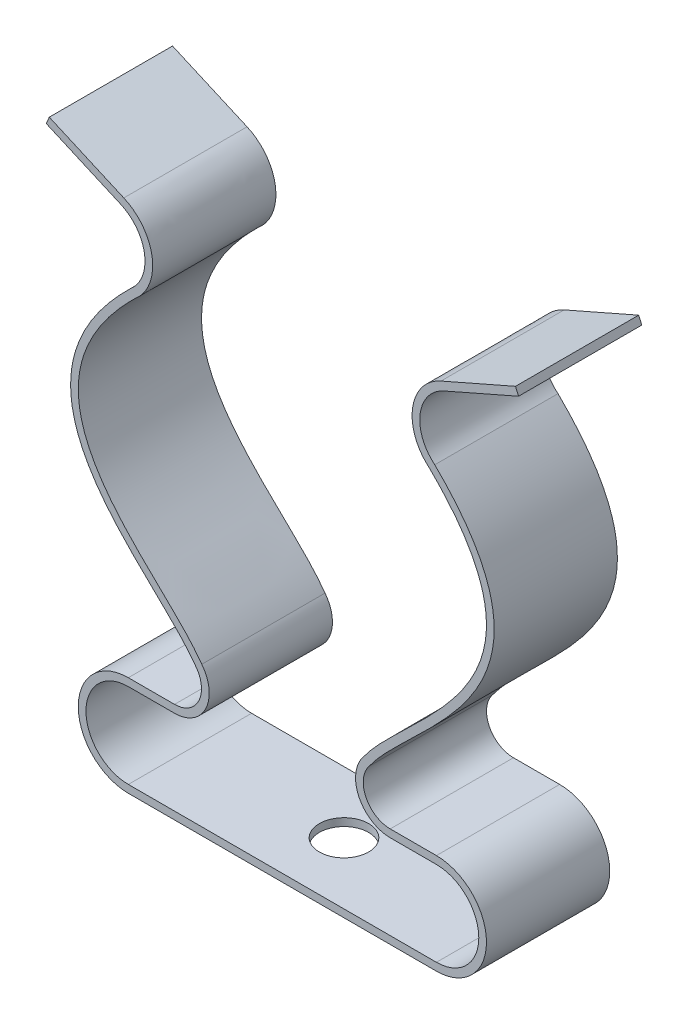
ISO-10303-21;
HEADER;
FILE_DESCRIPTION(('STEP AP214'),'2;1');
FILE_NAME('part.step','',(''),(''),'','','');
FILE_SCHEMA(('AUTOMOTIVE_DESIGN { 1 0 10303 214 1 1 1 1 }'));
ENDSEC;
DATA;
#1=APPLICATION_CONTEXT('core data for automotive mechanical design processes');
#2=APPLICATION_PROTOCOL_DEFINITION('international standard','automotive_design',2000,#1);
#3=PRODUCT_CONTEXT('',#1,'mechanical');
#4=PRODUCT('Part','Part','',(#3));
#5=PRODUCT_RELATED_PRODUCT_CATEGORY('part','',(#4));
#6=PRODUCT_DEFINITION_FORMATION('','',#4);
#7=PRODUCT_DEFINITION_CONTEXT('part definition',#1,'design');
#8=PRODUCT_DEFINITION('design','',#6,#7);
#9=PRODUCT_DEFINITION_SHAPE('','',#8);
#10=(LENGTH_UNIT() NAMED_UNIT(*) SI_UNIT(.MILLI.,.METRE.));
#11=(NAMED_UNIT(*) PLANE_ANGLE_UNIT() SI_UNIT($,.RADIAN.));
#12=(NAMED_UNIT(*) SI_UNIT($,.STERADIAN.) SOLID_ANGLE_UNIT());
#13=UNCERTAINTY_MEASURE_WITH_UNIT(LENGTH_MEASURE(1.E-05),#10,'distance_accuracy_value','');
#14=(GEOMETRIC_REPRESENTATION_CONTEXT(3) GLOBAL_UNCERTAINTY_ASSIGNED_CONTEXT((#13)) GLOBAL_UNIT_ASSIGNED_CONTEXT((#10,
#11,#12)) REPRESENTATION_CONTEXT('',''));
#15=CARTESIAN_POINT('',(0.,0.,0.));
#16=DIRECTION('',(0.,0.,1.));
#17=DIRECTION('',(1.,0.,0.));
#18=AXIS2_PLACEMENT_3D('',#15,#16,#17);
#19=CARTESIAN_POINT('',(10.2933929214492,33.0756328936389,0.));
#20=DIRECTION('',(-0.401751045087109,0.915748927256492,0.));
#21=DIRECTION('',(-0.915748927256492,-0.401751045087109,0.));
#22=AXIS2_PLACEMENT_3D('',#19,#20,#21);
#23=PLANE('',#22);
#24=DIRECTION('',(0.,0.,1.));
#25=VECTOR('',#24,1.);
#26=CARTESIAN_POINT('',(10.2933929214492,33.0756328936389,0.));
#27=LINE('',#26,#25);
#28=CARTESIAN_POINT('',(10.2933929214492,33.0756328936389,-4.));
#29=VERTEX_POINT('',#28);
#30=CARTESIAN_POINT('',(10.2933929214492,33.0756328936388,4.));
#31=VERTEX_POINT('',#30);
#32=EDGE_CURVE('E399',#29,#31,#27,.T.);
#33=ORIENTED_EDGE('',*,*,#32,.T.);
#34=DIRECTION('',(0.915748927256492,0.401751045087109,0.));
#35=VECTOR('',#34,1.);
#36=CARTESIAN_POINT('',(10.2933929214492,33.0756328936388,4.));
#37=LINE('',#36,#35);
#38=CARTESIAN_POINT('',(15.131841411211,35.1983236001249,4.));
#39=VERTEX_POINT('',#38);
#40=EDGE_CURVE('E536',#31,#39,#37,.T.);
#41=ORIENTED_EDGE('',*,*,#40,.T.);
#42=DIRECTION('',(0.,0.,1.));
#43=VECTOR('',#42,1.);
#44=CARTESIAN_POINT('',(15.131841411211,35.1983236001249,0.));
#45=LINE('',#44,#43);
#46=CARTESIAN_POINT('',(15.131841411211,35.1983236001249,-4.));
#47=VERTEX_POINT('',#46);
#48=EDGE_CURVE('E57',#47,#39,#45,.T.);
#49=ORIENTED_EDGE('',*,*,#48,.F.);
#50=DIRECTION('',(0.915748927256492,0.401751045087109,0.));
#51=VECTOR('',#50,1.);
#52=CARTESIAN_POINT('',(10.2933929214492,33.0756328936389,-4.));
#53=LINE('',#52,#51);
#54=EDGE_CURVE('E42',#29,#47,#53,.T.);
#55=ORIENTED_EDGE('',*,*,#54,.F.);
#56=EDGE_LOOP('',(#33,#41,#49,#55));
#57=FACE_BOUND('',#56,.T.);
#58=ADVANCED_FACE('F35',(#57),#23,.T.);
#59=CARTESIAN_POINT('',(10.4942693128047,32.6177564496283,0.));
#60=DIRECTION('',(0.401751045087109,-0.915748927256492,0.));
#61=DIRECTION('',(0.915748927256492,0.401751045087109,0.));
#62=AXIS2_PLACEMENT_3D('',#59,#60,#61);
#63=PLANE('',#62);
#64=DIRECTION('',(0.,0.,-1.));
#65=VECTOR('',#64,1.);
#66=CARTESIAN_POINT('',(10.4942693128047,32.6177564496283,0.));
#67=LINE('',#66,#65);
#68=CARTESIAN_POINT('',(10.4942693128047,32.6177564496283,4.));
#69=VERTEX_POINT('',#68);
#70=CARTESIAN_POINT('',(10.4942693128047,32.6177564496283,-4.));
#71=VERTEX_POINT('',#70);
#72=EDGE_CURVE('E416',#69,#71,#67,.T.);
#73=ORIENTED_EDGE('',*,*,#72,.T.);
#74=DIRECTION('',(0.915748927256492,0.401751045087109,0.));
#75=VECTOR('',#74,1.);
#76=CARTESIAN_POINT('',(10.4942693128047,32.6177564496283,-4.));
#77=LINE('',#76,#75);
#78=CARTESIAN_POINT('',(15.3327178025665,34.7404471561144,-4.));
#79=VERTEX_POINT('',#78);
#80=EDGE_CURVE('E11',#71,#79,#77,.T.);
#81=ORIENTED_EDGE('',*,*,#80,.T.);
#82=DIRECTION('',(0.,0.,-1.));
#83=VECTOR('',#82,1.);
#84=CARTESIAN_POINT('',(15.3327178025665,34.7404471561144,0.));
#85=LINE('',#84,#83);
#86=CARTESIAN_POINT('',(15.3327178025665,34.7404471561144,4.));
#87=VERTEX_POINT('',#86);
#88=EDGE_CURVE('E462',#87,#79,#85,.T.);
#89=ORIENTED_EDGE('',*,*,#88,.F.);
#90=DIRECTION('',(0.915748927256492,0.401751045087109,0.));
#91=VECTOR('',#90,1.);
#92=CARTESIAN_POINT('',(10.4942693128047,32.6177564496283,4.));
#93=LINE('',#92,#91);
#94=EDGE_CURVE('E533',#69,#87,#93,.T.);
#95=ORIENTED_EDGE('',*,*,#94,.F.);
#96=EDGE_LOOP('',(#73,#81,#89,#95));
#97=FACE_BOUND('',#96,.T.);
#98=ADVANCED_FACE('F548',(#97),#63,.T.);
#99=CARTESIAN_POINT('',(7.,8.,0.));
#100=DIRECTION('',(0.,0.,-1.));
#101=DIRECTION('',(-1.,0.,0.));
#102=AXIS2_PLACEMENT_3D('',#99,#100,#101);
#103=CYLINDRICAL_SURFACE('',#102,2.25);
#104=CARTESIAN_POINT('',(7.,8.,4.));
#105=DIRECTION('',(0.,0.,-1.));
#106=DIRECTION('',(-1.,0.,0.));
#107=AXIS2_PLACEMENT_3D('',#104,#105,#106);
#108=CIRCLE('',#107,2.25);
#109=CARTESIAN_POINT('',(7.,5.75,4.));
#110=VERTEX_POINT('',#109);
#111=CARTESIAN_POINT('',(5.23029402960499,9.38947500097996,4.));
#112=VERTEX_POINT('',#111);
#113=EDGE_CURVE('E513',#110,#112,#108,.T.);
#114=ORIENTED_EDGE('',*,*,#113,.T.);
#115=DIRECTION('',(0.,0.,-1.));
#116=VECTOR('',#115,1.);
#117=CARTESIAN_POINT('',(5.23029402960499,9.38947500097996,0.));
#118=LINE('',#117,#116);
#119=CARTESIAN_POINT('',(5.23029402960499,9.38947500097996,-4.));
#120=VERTEX_POINT('',#119);
#121=EDGE_CURVE('E459',#112,#120,#118,.T.);
#122=ORIENTED_EDGE('',*,*,#121,.T.);
#123=CARTESIAN_POINT('',(7.,8.,-4.));
#124=DIRECTION('',(0.,0.,-1.));
#125=DIRECTION('',(-1.,0.,0.));
#126=AXIS2_PLACEMENT_3D('',#123,#124,#125);
#127=CIRCLE('',#126,2.25);
#128=CARTESIAN_POINT('',(7.,5.75,-4.));
#129=VERTEX_POINT('',#128);
#130=EDGE_CURVE('E516',#129,#120,#127,.T.);
#131=ORIENTED_EDGE('',*,*,#130,.F.);
#132=DIRECTION('',(0.,0.,1.));
#133=VECTOR('',#132,1.);
#134=CARTESIAN_POINT('',(7.,5.75,4.));
#135=LINE('',#134,#133);
#136=EDGE_CURVE('E495',#129,#110,#135,.T.);
#137=ORIENTED_EDGE('',*,*,#136,.T.);
#138=EDGE_LOOP('',(#114,#122,#131,#137));
#139=FACE_BOUND('',#138,.T.);
#140=ADVANCED_FACE('F602',(#139),#103,.T.);
#141=CARTESIAN_POINT('',(7.,8.,0.));
#142=DIRECTION('',(0.,0.,-1.));
#143=DIRECTION('',(-1.,0.,0.));
#144=AXIS2_PLACEMENT_3D('',#141,#142,#143);
#145=CYLINDRICAL_SURFACE('',#144,1.75);
#146=CARTESIAN_POINT('',(7.,8.,-4.));
#147=DIRECTION('',(0.,0.,-1.));
#148=DIRECTION('',(-1.,0.,0.));
#149=AXIS2_PLACEMENT_3D('',#146,#147,#148);
#150=CIRCLE('',#149,1.75);
#151=CARTESIAN_POINT('',(7.,6.25,-4.));
#152=VERTEX_POINT('',#151);
#153=CARTESIAN_POINT('',(5.62999166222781,9.0888421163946,-4.));
#154=VERTEX_POINT('',#153);
#155=EDGE_CURVE('E519',#152,#154,#150,.T.);
#156=ORIENTED_EDGE('',*,*,#155,.T.);
#157=DIRECTION('',(0.,0.,-1.));
#158=VECTOR('',#157,1.);
#159=CARTESIAN_POINT('',(5.62999166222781,9.0888421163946,0.));
#160=LINE('',#159,#158);
#161=CARTESIAN_POINT('',(5.62999166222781,9.0888421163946,4.));
#162=VERTEX_POINT('',#161);
#163=EDGE_CURVE('E463',#154,#162,#160,.F.);
#164=ORIENTED_EDGE('',*,*,#163,.T.);
#165=CARTESIAN_POINT('',(7.,8.,4.));
#166=DIRECTION('',(0.,0.,-1.));
#167=DIRECTION('',(-1.,0.,0.));
#168=AXIS2_PLACEMENT_3D('',#165,#166,#167);
#169=CIRCLE('',#168,1.75);
#170=CARTESIAN_POINT('',(7.,6.25,4.));
#171=VERTEX_POINT('',#170);
#172=EDGE_CURVE('E522',#171,#162,#169,.T.);
#173=ORIENTED_EDGE('',*,*,#172,.F.);
#174=DIRECTION('',(0.,0.,-1.));
#175=VECTOR('',#174,1.);
#176=CARTESIAN_POINT('',(7.,6.25,4.));
#177=LINE('',#176,#175);
#178=EDGE_CURVE('E498',#171,#152,#177,.T.);
#179=ORIENTED_EDGE('',*,*,#178,.T.);
#180=EDGE_LOOP('',(#156,#164,#173,#179));
#181=FACE_BOUND('',#180,.T.);
#182=ADVANCED_FACE('F559',(#181),#145,.F.);
#183=CARTESIAN_POINT('',(10.,6.25,4.));
#184=DIRECTION('',(0.,1.,0.));
#185=DIRECTION('',(-1.,0.,0.));
#186=AXIS2_PLACEMENT_3D('',#183,#184,#185);
#187=PLANE('',#186);
#188=DIRECTION('',(0.,0.,-1.));
#189=VECTOR('',#188,1.);
#190=CARTESIAN_POINT('',(10.,6.25,4.));
#191=LINE('',#190,#189);
#192=CARTESIAN_POINT('',(10.,6.25,4.));
#193=VERTEX_POINT('',#192);
#194=CARTESIAN_POINT('',(10.,6.25,-4.));
#195=VERTEX_POINT('',#194);
#196=EDGE_CURVE('E480',#193,#195,#191,.T.);
#197=ORIENTED_EDGE('',*,*,#196,.T.);
#198=DIRECTION('',(-1.,0.,0.));
#199=VECTOR('',#198,1.);
#200=CARTESIAN_POINT('',(10.,6.25,-4.));
#201=LINE('',#200,#199);
#202=EDGE_CURVE('E507',#195,#152,#201,.T.);
#203=ORIENTED_EDGE('',*,*,#202,.T.);
#204=ORIENTED_EDGE('',*,*,#178,.F.);
#205=DIRECTION('',(-1.,0.,0.));
#206=VECTOR('',#205,1.);
#207=CARTESIAN_POINT('',(10.,6.25,4.));
#208=LINE('',#207,#206);
#209=EDGE_CURVE('E510',#193,#171,#208,.T.);
#210=ORIENTED_EDGE('',*,*,#209,.F.);
#211=EDGE_LOOP('',(#197,#203,#204,#210));
#212=FACE_BOUND('',#211,.T.);
#213=ADVANCED_FACE('F563',(#212),#187,.T.);
#214=CARTESIAN_POINT('',(10.,5.75,4.));
#215=DIRECTION('',(0.,-1.,0.));
#216=DIRECTION('',(1.,0.,0.));
#217=AXIS2_PLACEMENT_3D('',#214,#215,#216);
#218=PLANE('',#217);
#219=DIRECTION('',(0.,0.,1.));
#220=VECTOR('',#219,1.);
#221=CARTESIAN_POINT('',(10.,5.75,4.));
#222=LINE('',#221,#220);
#223=CARTESIAN_POINT('',(10.,5.75,-4.));
#224=VERTEX_POINT('',#223);
#225=CARTESIAN_POINT('',(10.,5.75,4.));
#226=VERTEX_POINT('',#225);
#227=EDGE_CURVE('E477',#224,#226,#222,.T.);
#228=ORIENTED_EDGE('',*,*,#227,.T.);
#229=DIRECTION('',(-1.,0.,0.));
#230=VECTOR('',#229,1.);
#231=CARTESIAN_POINT('',(10.,5.75,4.));
#232=LINE('',#231,#230);
#233=EDGE_CURVE('E501',#226,#110,#232,.T.);
#234=ORIENTED_EDGE('',*,*,#233,.T.);
#235=ORIENTED_EDGE('',*,*,#136,.F.);
#236=DIRECTION('',(-1.,0.,0.));
#237=VECTOR('',#236,1.);
#238=CARTESIAN_POINT('',(10.,5.75,-4.));
#239=LINE('',#238,#237);
#240=EDGE_CURVE('E504',#224,#129,#239,.T.);
#241=ORIENTED_EDGE('',*,*,#240,.F.);
#242=EDGE_LOOP('',(#228,#234,#235,#241));
#243=FACE_BOUND('',#242,.T.);
#244=ADVANCED_FACE('F613',(#243),#218,.T.);
#245=CARTESIAN_POINT('',(10.,3.,0.));
#246=DIRECTION('',(0.,0.,1.));
#247=DIRECTION('',(1.,0.,0.));
#248=AXIS2_PLACEMENT_3D('',#245,#246,#247);
#249=CYLINDRICAL_SURFACE('',#248,3.25);
#250=DIRECTION('',(0.,0.,-1.));
#251=VECTOR('',#250,1.);
#252=CARTESIAN_POINT('',(10.,-0.250000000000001,4.));
#253=LINE('',#252,#251);
#254=CARTESIAN_POINT('',(10.,-0.250000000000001,4.));
#255=VERTEX_POINT('',#254);
#256=CARTESIAN_POINT('',(10.,-0.250000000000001,-4.));
#257=VERTEX_POINT('',#256);
#258=EDGE_CURVE('E456',#255,#257,#253,.T.);
#259=ORIENTED_EDGE('',*,*,#258,.T.);
#260=CARTESIAN_POINT('',(10.,3.,-4.));
#261=DIRECTION('',(0.,0.,1.));
#262=DIRECTION('',(1.,0.,0.));
#263=AXIS2_PLACEMENT_3D('',#260,#261,#262);
#264=CIRCLE('',#263,3.25);
#265=EDGE_CURVE('E489',#257,#195,#264,.T.);
#266=ORIENTED_EDGE('',*,*,#265,.T.);
#267=ORIENTED_EDGE('',*,*,#196,.F.);
#268=CARTESIAN_POINT('',(10.,3.,4.));
#269=DIRECTION('',(0.,0.,1.));
#270=DIRECTION('',(1.,0.,0.));
#271=AXIS2_PLACEMENT_3D('',#268,#269,#270);
#272=CIRCLE('',#271,3.25);
#273=EDGE_CURVE('E492',#255,#193,#272,.T.);
#274=ORIENTED_EDGE('',*,*,#273,.F.);
#275=EDGE_LOOP('',(#259,#266,#267,#274));
#276=FACE_BOUND('',#275,.T.);
#277=ADVANCED_FACE('F565',(#276),#249,.T.);
#278=CARTESIAN_POINT('',(10.,3.,0.));
#279=DIRECTION('',(0.,0.,1.));
#280=DIRECTION('',(1.,0.,0.));
#281=AXIS2_PLACEMENT_3D('',#278,#279,#280);
#282=CYLINDRICAL_SURFACE('',#281,2.75);
#283=DIRECTION('',(0.,0.,1.));
#284=VECTOR('',#283,1.);
#285=CARTESIAN_POINT('',(10.,0.249999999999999,4.));
#286=LINE('',#285,#284);
#287=CARTESIAN_POINT('',(10.,0.249999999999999,-4.));
#288=VERTEX_POINT('',#287);
#289=CARTESIAN_POINT('',(10.,0.249999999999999,4.));
#290=VERTEX_POINT('',#289);
#291=EDGE_CURVE('E466',#288,#290,#286,.T.);
#292=ORIENTED_EDGE('',*,*,#291,.T.);
#293=CARTESIAN_POINT('',(10.,3.,4.));
#294=DIRECTION('',(0.,0.,1.));
#295=DIRECTION('',(1.,0.,0.));
#296=AXIS2_PLACEMENT_3D('',#293,#294,#295);
#297=CIRCLE('',#296,2.75);
#298=EDGE_CURVE('E483',#290,#226,#297,.T.);
#299=ORIENTED_EDGE('',*,*,#298,.T.);
#300=ORIENTED_EDGE('',*,*,#227,.F.);
#301=CARTESIAN_POINT('',(10.,3.,-4.));
#302=DIRECTION('',(0.,0.,1.));
#303=DIRECTION('',(1.,0.,0.));
#304=AXIS2_PLACEMENT_3D('',#301,#302,#303);
#305=CIRCLE('',#304,2.75);
#306=EDGE_CURVE('E486',#288,#224,#305,.T.);
#307=ORIENTED_EDGE('',*,*,#306,.F.);
#308=EDGE_LOOP('',(#292,#299,#300,#307));
#309=FACE_BOUND('',#308,.T.);
#310=ADVANCED_FACE('F619',(#309),#282,.F.);
#311=CARTESIAN_POINT('',(10.,0.249999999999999,4.));
#312=DIRECTION('',(0.,0.,-1.));
#313=DIRECTION('',(-1.,0.,0.));
#314=AXIS2_PLACEMENT_3D('',#311,#312,#313);
#315=PLANE('',#314);
#316=DIRECTION('',(-1.,0.,0.));
#317=VECTOR('',#316,1.);
#318=CARTESIAN_POINT('',(10.,0.249999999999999,4.));
#319=LINE('',#318,#317);
#320=CARTESIAN_POINT('',(-10.,0.249999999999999,4.));
#321=VERTEX_POINT('',#320);
#322=EDGE_CURVE('E469',#290,#321,#319,.T.);
#323=ORIENTED_EDGE('',*,*,#322,.T.);
#324=CARTESIAN_POINT('',(-10.,3.,4.));
#325=DIRECTION('',(0.,0.,-1.));
#326=DIRECTION('',(-1.,0.,0.));
#327=AXIS2_PLACEMENT_3D('',#324,#325,#326);
#328=CIRCLE('',#327,2.75);
#329=CARTESIAN_POINT('',(-10.,5.75,4.));
#330=VERTEX_POINT('',#329);
#331=EDGE_CURVE('E341',#321,#330,#328,.T.);
#332=ORIENTED_EDGE('',*,*,#331,.T.);
#333=DIRECTION('',(1.,0.,0.));
#334=VECTOR('',#333,1.);
#335=CARTESIAN_POINT('',(-10.,5.75,4.));
#336=LINE('',#335,#334);
#337=CARTESIAN_POINT('',(-7.,5.75,4.));
#338=VERTEX_POINT('',#337);
#339=EDGE_CURVE('E359',#330,#338,#336,.T.);
#340=ORIENTED_EDGE('',*,*,#339,.T.);
#341=CARTESIAN_POINT('',(-7.,8.,4.));
#342=DIRECTION('',(0.,0.,1.));
#343=DIRECTION('',(1.,0.,0.));
#344=AXIS2_PLACEMENT_3D('',#341,#342,#343);
#345=CIRCLE('',#344,2.25);
#346=CARTESIAN_POINT('',(-5.23029402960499,9.38947500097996,4.));
#347=VERTEX_POINT('',#346);
#348=EDGE_CURVE('E320',#338,#347,#345,.T.);
#349=ORIENTED_EDGE('',*,*,#348,.T.);
#350=CARTESIAN_POINT('',(-5.23029402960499,9.38947500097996,4.));
#351=CARTESIAN_POINT('',(-5.82404843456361,10.2184628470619,4.));
#352=CARTESIAN_POINT('',(-7.41598068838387,11.8036596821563,4.));
#353=CARTESIAN_POINT('',(-9.85848996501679,14.1115201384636,4.));
#354=CARTESIAN_POINT('',(-11.7743872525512,16.3624710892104,4.));
#355=CARTESIAN_POINT('',(-12.8352853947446,18.4127808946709,4.));
#356=CARTESIAN_POINT('',(-13.2756268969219,20.0604331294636,4.));
#357=CARTESIAN_POINT('',(-13.2579900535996,21.5771493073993,4.));
#358=CARTESIAN_POINT('',(-12.9404570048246,22.9054004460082,4.));
#359=CARTESIAN_POINT('',(-12.4595047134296,24.067031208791,4.));
#360=CARTESIAN_POINT('',(-11.7415753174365,25.2812897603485,4.));
#361=CARTESIAN_POINT('',(-10.7626398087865,26.5538675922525,4.));
#362=CARTESIAN_POINT('',(-9.98674078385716,27.3745609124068,4.));
#363=CARTESIAN_POINT('',(-9.55679978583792,27.7942139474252,4.));
#364=B_SPLINE_CURVE_WITH_KNOTS('',3,(#350,#351,#352,#353,#354,#355,#356,#357,#358,#359,#360,
#361,#362,#363),.UNSPECIFIED.,.F.,.F.,(4,1,1,1,1,1,1,1,1,1,1,4),(0.,0.132510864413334,
0.288149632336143,0.446720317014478,0.523436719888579,0.599267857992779,0.677988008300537,
0.729263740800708,0.785463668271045,0.848256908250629,0.919254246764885,1.),.UNSPECIFIED.);
#365=CARTESIAN_POINT('',(-9.55679978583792,27.7942139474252,4.));
#366=VERTEX_POINT('',#365);
#367=EDGE_CURVE('E301',#347,#366,#364,.T.);
#368=ORIENTED_EDGE('',*,*,#367,.T.);
#369=CARTESIAN_POINT('',(-9.55679978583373,27.7942139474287,4.));
#370=CARTESIAN_POINT('',(-9.42016125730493,27.9063296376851,4.));
#371=CARTESIAN_POINT('',(-9.18359716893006,28.1385182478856,4.));
#372=CARTESIAN_POINT('',(-8.89442812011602,28.530229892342,4.));
#373=CARTESIAN_POINT('',(-8.69455109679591,28.9057304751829,4.));
#374=CARTESIAN_POINT('',(-8.56114249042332,29.2568973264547,4.));
#375=CARTESIAN_POINT('',(-8.47900733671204,29.5775558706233,4.));
#376=CARTESIAN_POINT('',(-8.43472117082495,29.8666509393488,4.));
#377=CARTESIAN_POINT('',(-8.41773720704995,30.1295955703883,4.));
#378=CARTESIAN_POINT('',(-8.42213139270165,30.4184683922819,4.));
#379=CARTESIAN_POINT('',(-8.46113277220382,30.7639054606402,4.));
#380=CARTESIAN_POINT('',(-8.56516228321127,31.1890550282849,4.));
#381=CARTESIAN_POINT('',(-8.73009945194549,31.589522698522,4.));
#382=CARTESIAN_POINT('',(-8.94032921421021,31.9496898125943,4.));
#383=CARTESIAN_POINT('',(-9.17481463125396,32.2605910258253,4.));
#384=CARTESIAN_POINT('',(-9.47541353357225,32.5666441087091,4.));
#385=CARTESIAN_POINT('',(-9.84925087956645,32.8516534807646,4.));
#386=CARTESIAN_POINT('',(-10.1377425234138,33.0073470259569,4.));
#387=CARTESIAN_POINT('',(-10.2933929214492,33.0756328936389,4.));
#388=B_SPLINE_CURVE_WITH_KNOTS('',3,(#369,#370,#371,#372,#373,#374,#375,#376,#377,#378,#379,
#380,#381,#382,#383,#384,#385,#386,#387),.UNSPECIFIED.,.F.,.F.,(4,1,1,1,1,1,1,1,1,1,1,1,1,1,1,1,
4),(0.,0.0848404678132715,0.15987757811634,0.226074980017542,0.284399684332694,
0.335829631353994,0.381280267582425,0.421571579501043,0.45945068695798,0.516855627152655,
0.584463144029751,0.664406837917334,0.719304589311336,0.779975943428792,0.846837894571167,
0.920165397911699,1.),.UNSPECIFIED.);
#389=CARTESIAN_POINT('',(-10.2933929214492,33.0756328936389,4.));
#390=VERTEX_POINT('',#389);
#391=EDGE_CURVE('E268',#366,#390,#388,.T.);
#392=ORIENTED_EDGE('',*,*,#391,.T.);
#393=DIRECTION('',(-0.915748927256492,0.401751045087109,0.));
#394=VECTOR('',#393,1.);
#395=CARTESIAN_POINT('',(-10.2933929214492,33.0756328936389,4.));
#396=LINE('',#395,#394);
#397=CARTESIAN_POINT('',(-15.131841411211,35.1983236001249,4.));
#398=VERTEX_POINT('',#397);
#399=EDGE_CURVE('E384',#390,#398,#396,.T.);
#400=ORIENTED_EDGE('',*,*,#399,.T.);
#401=DIRECTION('',(0.401751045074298,0.915748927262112,0.));
#402=VECTOR('',#401,1.);
#403=CARTESIAN_POINT('',(-15.2322796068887,34.9693853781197,4.));
#404=LINE('',#403,#402);
#405=CARTESIAN_POINT('',(-15.3327178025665,34.7404471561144,4.));
#406=VERTEX_POINT('',#405);
#407=EDGE_CURVE('E228',#406,#398,#404,.T.);
#408=ORIENTED_EDGE('',*,*,#407,.F.);
#409=DIRECTION('',(-0.915748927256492,0.401751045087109,0.));
#410=VECTOR('',#409,1.);
#411=CARTESIAN_POINT('',(-10.4942693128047,32.6177564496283,4.));
#412=LINE('',#411,#410);
#413=CARTESIAN_POINT('',(-10.4942693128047,32.6177564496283,4.));
#414=VERTEX_POINT('',#413);
#415=EDGE_CURVE('E220',#414,#406,#412,.T.);
#416=ORIENTED_EDGE('',*,*,#415,.F.);
#417=CARTESIAN_POINT('',(-9.89062445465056,28.167078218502,4.));
#418=CARTESIAN_POINT('',(-9.77071252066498,28.2654692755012,4.));
#419=CARTESIAN_POINT('',(-9.55747714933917,28.4724353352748,4.));
#420=CARTESIAN_POINT('',(-9.31961951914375,28.7973839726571,4.));
#421=CARTESIAN_POINT('',(-9.15051925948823,29.1138603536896,4.));
#422=CARTESIAN_POINT('',(-9.03866488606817,29.4087472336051,4.));
#423=CARTESIAN_POINT('',(-8.96958904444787,29.6782497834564,4.));
#424=CARTESIAN_POINT('',(-8.93238672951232,29.9211728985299,4.));
#425=CARTESIAN_POINT('',(-8.91811193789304,30.1421336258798,4.));
#426=CARTESIAN_POINT('',(-8.92180521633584,30.3848795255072,4.));
#427=CARTESIAN_POINT('',(-8.95457867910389,30.6751585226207,4.));
#428=CARTESIAN_POINT('',(-9.04199719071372,31.0324214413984,4.));
#429=CARTESIAN_POINT('',(-9.18059767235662,31.3689437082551,4.));
#430=CARTESIAN_POINT('',(-9.35725860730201,31.6716004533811,4.));
#431=CARTESIAN_POINT('',(-9.55430212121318,31.9328579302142,4.));
#432=CARTESIAN_POINT('',(-9.80690232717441,32.1900414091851,4.));
#433=CARTESIAN_POINT('',(-10.1210464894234,32.4295413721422,4.));
#434=CARTESIAN_POINT('',(-10.3634726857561,32.5603742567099,4.));
#435=CARTESIAN_POINT('',(-10.4942693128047,32.6177564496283,4.));
#436=B_SPLINE_CURVE_WITH_KNOTS('',3,(#417,#418,#419,#420,#421,#422,#423,#424,#425,#426,#427,
#428,#429,#430,#431,#432,#433,#434,#435),.UNSPECIFIED.,.F.,.F.,(4,1,1,1,1,1,1,1,1,1,1,1,1,1,1,1,
4),(0.,0.0848404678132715,0.15987757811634,0.226074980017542,0.284399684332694,
0.335829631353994,0.381280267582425,0.421571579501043,0.45945068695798,0.516855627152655,
0.584463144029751,0.664406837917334,0.719304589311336,0.779975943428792,0.846837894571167,
0.920165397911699,1.),.UNSPECIFIED.);
#437=CARTESIAN_POINT('',(-9.89062445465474,28.1670782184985,4.));
#438=VERTEX_POINT('',#437);
#439=EDGE_CURVE('E225',#438,#414,#436,.T.);
#440=ORIENTED_EDGE('',*,*,#439,.F.);
#441=CARTESIAN_POINT('',(-5.62999166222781,9.0888421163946,4.));
#442=CARTESIAN_POINT('',(-6.20911860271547,9.8974073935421,4.));
#443=CARTESIAN_POINT('',(-7.74611583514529,11.4262873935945,4.));
#444=CARTESIAN_POINT('',(-10.2158862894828,13.7616454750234,4.));
#445=CARTESIAN_POINT('',(-12.1826348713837,16.0656684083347,4.));
#446=CARTESIAN_POINT('',(-13.3030801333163,18.2252295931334,4.));
#447=CARTESIAN_POINT('',(-13.7777889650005,19.9949308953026,4.));
#448=CARTESIAN_POINT('',(-13.7585626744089,21.6381773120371,4.));
#449=CARTESIAN_POINT('',(-13.4170439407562,23.0632450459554,4.));
#450=CARTESIAN_POINT('',(-12.9067762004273,24.2944172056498,4.));
#451=CARTESIAN_POINT('',(-12.1538868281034,25.5658869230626,4.));
#452=CARTESIAN_POINT('',(-11.1450320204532,26.8780207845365,4.));
#453=CARTESIAN_POINT('',(-10.3369244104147,27.7314576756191,4.));
#454=CARTESIAN_POINT('',(-9.89062445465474,28.1670782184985,4.));
#455=B_SPLINE_CURVE_WITH_KNOTS('',3,(#441,#442,#443,#444,#445,#446,#447,#448,#449,#450,#451,
#452,#453,#454),.UNSPECIFIED.,.F.,.F.,(4,1,1,1,1,1,1,1,1,1,1,4),(0.,0.132510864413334,
0.288149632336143,0.446720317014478,0.523436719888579,0.599267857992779,0.677988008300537,
0.729263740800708,0.785463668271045,0.848256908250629,0.919254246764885,1.),.UNSPECIFIED.);
#456=CARTESIAN_POINT('',(-5.62999166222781,9.0888421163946,4.));
#457=VERTEX_POINT('',#456);
#458=EDGE_CURVE('E281',#457,#438,#455,.T.);
#459=ORIENTED_EDGE('',*,*,#458,.F.);
#460=CARTESIAN_POINT('',(-7.,8.,4.));
#461=DIRECTION('',(0.,0.,1.));
#462=DIRECTION('',(1.,0.,0.));
#463=AXIS2_PLACEMENT_3D('',#460,#461,#462);
#464=CIRCLE('',#463,1.75);
#465=CARTESIAN_POINT('',(-7.,6.25,4.));
#466=VERTEX_POINT('',#465);
#467=EDGE_CURVE('E362',#466,#457,#464,.T.);
#468=ORIENTED_EDGE('',*,*,#467,.F.);
#469=DIRECTION('',(1.,0.,0.));
#470=VECTOR('',#469,1.);
#471=CARTESIAN_POINT('',(-10.,6.25,4.));
#472=LINE('',#471,#470);
#473=CARTESIAN_POINT('',(-10.,6.25,4.));
#474=VERTEX_POINT('',#473);
#475=EDGE_CURVE('E350',#474,#466,#472,.T.);
#476=ORIENTED_EDGE('',*,*,#475,.F.);
#477=CARTESIAN_POINT('',(-10.,3.,4.));
#478=DIRECTION('',(0.,0.,-1.));
#479=DIRECTION('',(-1.,0.,0.));
#480=AXIS2_PLACEMENT_3D('',#477,#478,#479);
#481=CIRCLE('',#480,3.25);
#482=CARTESIAN_POINT('',(-10.,-0.250000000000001,4.));
#483=VERTEX_POINT('',#482);
#484=EDGE_CURVE('E332',#483,#474,#481,.T.);
#485=ORIENTED_EDGE('',*,*,#484,.F.);
#486=DIRECTION('',(-1.,0.,0.));
#487=VECTOR('',#486,1.);
#488=CARTESIAN_POINT('',(10.,-0.250000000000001,4.));
#489=LINE('',#488,#487);
#490=EDGE_CURVE('E475',#255,#483,#489,.T.);
#491=ORIENTED_EDGE('',*,*,#490,.F.);
#492=ORIENTED_EDGE('',*,*,#273,.T.);
#493=ORIENTED_EDGE('',*,*,#209,.T.);
#494=ORIENTED_EDGE('',*,*,#172,.T.);
#495=CARTESIAN_POINT('',(5.62999166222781,9.0888421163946,4.));
#496=CARTESIAN_POINT('',(6.20911860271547,9.8974073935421,4.));
#497=CARTESIAN_POINT('',(7.74611583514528,11.4262873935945,4.));
#498=CARTESIAN_POINT('',(10.2158862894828,13.7616454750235,4.));
#499=CARTESIAN_POINT('',(12.1826348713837,16.0656684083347,4.));
#500=CARTESIAN_POINT('',(13.3030801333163,18.2252295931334,4.));
#501=CARTESIAN_POINT('',(13.7777889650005,19.9949308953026,4.));
#502=CARTESIAN_POINT('',(13.7585626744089,21.6381773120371,4.));
#503=CARTESIAN_POINT('',(13.4170439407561,23.0632450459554,4.));
#504=CARTESIAN_POINT('',(12.9067762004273,24.2944172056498,4.));
#505=CARTESIAN_POINT('',(12.1538868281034,25.5658869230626,4.));
#506=CARTESIAN_POINT('',(11.1450320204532,26.8780207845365,4.));
#507=CARTESIAN_POINT('',(10.3369244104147,27.7314576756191,4.));
#508=CARTESIAN_POINT('',(9.89062445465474,28.1670782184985,4.));
#509=B_SPLINE_CURVE_WITH_KNOTS('',3,(#495,#496,#497,#498,#499,#500,#501,#502,#503,#504,#505,
#506,#507,#508),.UNSPECIFIED.,.F.,.F.,(4,1,1,1,1,1,1,1,1,1,1,4),(0.,0.132510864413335,
0.288149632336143,0.446720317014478,0.523436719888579,0.59926785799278,0.677988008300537,
0.729263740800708,0.785463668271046,0.848256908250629,0.919254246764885,1.),.UNSPECIFIED.);
#510=CARTESIAN_POINT('',(9.89062445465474,28.1670782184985,4.));
#511=VERTEX_POINT('',#510);
#512=EDGE_CURVE('E422',#162,#511,#509,.T.);
#513=ORIENTED_EDGE('',*,*,#512,.T.);
#514=CARTESIAN_POINT('',(9.89062445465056,28.167078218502,4.));
#515=CARTESIAN_POINT('',(9.77071252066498,28.2654692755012,4.));
#516=CARTESIAN_POINT('',(9.55747714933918,28.4724353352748,4.));
#517=CARTESIAN_POINT('',(9.31961951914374,28.7973839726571,4.));
#518=CARTESIAN_POINT('',(9.15051925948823,29.1138603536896,4.));
#519=CARTESIAN_POINT('',(9.03866488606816,29.4087472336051,4.));
#520=CARTESIAN_POINT('',(8.96958904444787,29.6782497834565,4.));
#521=CARTESIAN_POINT('',(8.93238672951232,29.9211728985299,4.));
#522=CARTESIAN_POINT('',(8.91811193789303,30.1421336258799,4.));
#523=CARTESIAN_POINT('',(8.92180521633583,30.3848795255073,4.));
#524=CARTESIAN_POINT('',(8.95457867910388,30.6751585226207,4.));
#525=CARTESIAN_POINT('',(9.04199719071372,31.0324214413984,4.));
#526=CARTESIAN_POINT('',(9.18059767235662,31.3689437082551,4.));
#527=CARTESIAN_POINT('',(9.357258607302,31.6716004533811,4.));
#528=CARTESIAN_POINT('',(9.55430212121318,31.9328579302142,4.));
#529=CARTESIAN_POINT('',(9.80690232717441,32.1900414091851,4.));
#530=CARTESIAN_POINT('',(10.1210464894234,32.4295413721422,4.));
#531=CARTESIAN_POINT('',(10.3634726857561,32.5603742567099,4.));
#532=CARTESIAN_POINT('',(10.4942693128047,32.6177564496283,4.));
#533=B_SPLINE_CURVE_WITH_KNOTS('',3,(#514,#515,#516,#517,#518,#519,#520,#521,#522,#523,#524,
#525,#526,#527,#528,#529,#530,#531,#532),.UNSPECIFIED.,.F.,.F.,(4,1,1,1,1,1,1,1,1,1,1,1,1,1,1,1,
4),(0.,0.0848404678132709,0.159877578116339,0.226074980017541,0.284399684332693,
0.335829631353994,0.381280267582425,0.421571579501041,0.45945068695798,0.516855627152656,
0.58446314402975,0.664406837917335,0.719304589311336,0.779975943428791,0.846837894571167,
0.920165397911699,1.),.UNSPECIFIED.);
#534=EDGE_CURVE('E386',#511,#69,#533,.T.);
#535=ORIENTED_EDGE('',*,*,#534,.T.);
#536=ORIENTED_EDGE('',*,*,#94,.T.);
#537=DIRECTION('',(0.401751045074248,-0.915748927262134,0.));
#538=VECTOR('',#537,1.);
#539=CARTESIAN_POINT('',(15.2322796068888,34.9693853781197,4.));
#540=LINE('',#539,#538);
#541=EDGE_CURVE('E528',#39,#87,#540,.T.);
#542=ORIENTED_EDGE('',*,*,#541,.F.);
#543=ORIENTED_EDGE('',*,*,#40,.F.);
#544=CARTESIAN_POINT('',(9.55679978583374,27.7942139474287,4.));
#545=CARTESIAN_POINT('',(9.42016125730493,27.906329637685,4.));
#546=CARTESIAN_POINT('',(9.18359716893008,28.1385182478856,4.00000000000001));
#547=CARTESIAN_POINT('',(8.89442812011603,28.530229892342,4.));
#548=CARTESIAN_POINT('',(8.69455109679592,28.9057304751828,4.));
#549=CARTESIAN_POINT('',(8.56114249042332,29.2568973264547,4.));
#550=CARTESIAN_POINT('',(8.47900733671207,29.5775558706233,4.));
#551=CARTESIAN_POINT('',(8.43472117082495,29.8666509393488,4.));
#552=CARTESIAN_POINT('',(8.41773720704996,30.1295955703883,4.));
#553=CARTESIAN_POINT('',(8.42213139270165,30.4184683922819,4.00000000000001));
#554=CARTESIAN_POINT('',(8.46113277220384,30.7639054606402,4.));
#555=CARTESIAN_POINT('',(8.56516228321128,31.1890550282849,4.));
#556=CARTESIAN_POINT('',(8.73009945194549,31.589522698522,4.));
#557=CARTESIAN_POINT('',(8.94032921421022,31.9496898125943,4.));
#558=CARTESIAN_POINT('',(9.17481463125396,32.2605910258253,4.));
#559=CARTESIAN_POINT('',(9.47541353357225,32.5666441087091,4.));
#560=CARTESIAN_POINT('',(9.84925087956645,32.8516534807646,4.));
#561=CARTESIAN_POINT('',(10.1377425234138,33.0073470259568,4.));
#562=CARTESIAN_POINT('',(10.2933929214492,33.0756328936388,4.));
#563=B_SPLINE_CURVE_WITH_KNOTS('',3,(#544,#545,#546,#547,#548,#549,#550,#551,#552,#553,#554,
#555,#556,#557,#558,#559,#560,#561,#562),.UNSPECIFIED.,.F.,.F.,(4,1,1,1,1,1,1,1,1,1,1,1,1,1,1,1,
4),(0.,0.0848404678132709,0.159877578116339,0.226074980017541,0.284399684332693,
0.335829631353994,0.381280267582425,0.421571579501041,0.45945068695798,0.516855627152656,
0.58446314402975,0.664406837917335,0.719304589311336,0.779975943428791,0.846837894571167,
0.920165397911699,1.),.UNSPECIFIED.);
#564=CARTESIAN_POINT('',(9.55679978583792,27.7942139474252,4.));
#565=VERTEX_POINT('',#564);
#566=EDGE_CURVE('E391',#565,#31,#563,.T.);
#567=ORIENTED_EDGE('',*,*,#566,.F.);
#568=CARTESIAN_POINT('',(5.23029402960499,9.38947500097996,4.));
#569=CARTESIAN_POINT('',(5.82404843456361,10.2184628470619,4.));
#570=CARTESIAN_POINT('',(7.41598068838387,11.8036596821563,4.));
#571=CARTESIAN_POINT('',(9.8584899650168,14.1115201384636,4.));
#572=CARTESIAN_POINT('',(11.7743872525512,16.3624710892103,4.));
#573=CARTESIAN_POINT('',(12.8352853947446,18.4127808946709,4.));
#574=CARTESIAN_POINT('',(13.2756268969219,20.0604331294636,4.));
#575=CARTESIAN_POINT('',(13.2579900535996,21.5771493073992,4.));
#576=CARTESIAN_POINT('',(12.9404570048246,22.9054004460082,4.));
#577=CARTESIAN_POINT('',(12.4595047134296,24.067031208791,4.));
#578=CARTESIAN_POINT('',(11.7415753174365,25.2812897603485,4.));
#579=CARTESIAN_POINT('',(10.7626398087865,26.5538675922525,4.));
#580=CARTESIAN_POINT('',(9.98674078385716,27.3745609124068,4.));
#581=CARTESIAN_POINT('',(9.55679978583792,27.7942139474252,4.));
#582=B_SPLINE_CURVE_WITH_KNOTS('',3,(#568,#569,#570,#571,#572,#573,#574,#575,#576,#577,#578,
#579,#580,#581),.UNSPECIFIED.,.F.,.F.,(4,1,1,1,1,1,1,1,1,1,1,4),(0.,0.132510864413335,
0.288149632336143,0.446720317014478,0.523436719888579,0.59926785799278,0.677988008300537,
0.729263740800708,0.785463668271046,0.848256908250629,0.919254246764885,1.),.UNSPECIFIED.);
#583=EDGE_CURVE('E428',#112,#565,#582,.T.);
#584=ORIENTED_EDGE('',*,*,#583,.F.);
#585=ORIENTED_EDGE('',*,*,#113,.F.);
#586=ORIENTED_EDGE('',*,*,#233,.F.);
#587=ORIENTED_EDGE('',*,*,#298,.F.);
#588=EDGE_LOOP('',(#323,#332,#340,#349,#368,#392,#400,#408,#416,#440,#459,#468,#476,#485,#491,
#492,#493,#494,#513,#535,#536,#542,#543,#567,#584,#585,#586,#587));
#589=FACE_BOUND('',#588,.T.);
#590=ADVANCED_FACE('F222',(#589),#315,.F.);
#591=CARTESIAN_POINT('',(10.,-0.250000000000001,4.));
#592=DIRECTION('',(0.,1.,0.));
#593=DIRECTION('',(-1.,0.,0.));
#594=AXIS2_PLACEMENT_3D('',#591,#592,#593);
#595=PLANE('',#594);
#596=CARTESIAN_POINT('',(0.,-0.25,0.));
#597=DIRECTION('',(0.,1.,0.));
#598=DIRECTION('',(-1.,0.,0.));
#599=AXIS2_PLACEMENT_3D('',#596,#597,#598);
#600=CIRCLE('',#599,1.6);
#601=CARTESIAN_POINT('',(-1.6,-0.25,0.));
#602=VERTEX_POINT('',#601);
#603=EDGE_CURVE('E241',#602,#602,#600,.T.);
#604=ORIENTED_EDGE('',*,*,#603,.T.);
#605=EDGE_LOOP('',(#604));
#606=FACE_BOUND('',#605,.T.);
#607=ORIENTED_EDGE('',*,*,#490,.T.);
#608=DIRECTION('',(0.,0.,-1.));
#609=VECTOR('',#608,1.);
#610=CARTESIAN_POINT('',(-10.,-0.250000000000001,4.));
#611=LINE('',#610,#609);
#612=CARTESIAN_POINT('',(-10.,-0.250000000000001,-4.));
#613=VERTEX_POINT('',#612);
#614=EDGE_CURVE('E323',#483,#613,#611,.T.);
#615=ORIENTED_EDGE('',*,*,#614,.T.);
#616=DIRECTION('',(-1.,0.,0.));
#617=VECTOR('',#616,1.);
#618=CARTESIAN_POINT('',(10.,-0.250000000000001,-4.));
#619=LINE('',#618,#617);
#620=EDGE_CURVE('E473',#257,#613,#619,.T.);
#621=ORIENTED_EDGE('',*,*,#620,.F.);
#622=ORIENTED_EDGE('',*,*,#258,.F.);
#623=EDGE_LOOP('',(#607,#615,#621,#622));
#624=FACE_BOUND('',#623,.T.);
#625=ADVANCED_FACE('F570',(#606,#624),#595,.F.);
#626=CARTESIAN_POINT('',(10.,0.249999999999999,-4.));
#627=DIRECTION('',(0.,0.,1.));
#628=DIRECTION('',(1.,0.,0.));
#629=AXIS2_PLACEMENT_3D('',#626,#627,#628);
#630=PLANE('',#629);
#631=ORIENTED_EDGE('',*,*,#620,.T.);
#632=CARTESIAN_POINT('',(-10.,3.,-4.));
#633=DIRECTION('',(0.,0.,-1.));
#634=DIRECTION('',(-1.,0.,0.));
#635=AXIS2_PLACEMENT_3D('',#632,#633,#634);
#636=CIRCLE('',#635,3.25);
#637=CARTESIAN_POINT('',(-10.,6.25,-4.));
#638=VERTEX_POINT('',#637);
#639=EDGE_CURVE('E335',#613,#638,#636,.T.);
#640=ORIENTED_EDGE('',*,*,#639,.T.);
#641=DIRECTION('',(1.,0.,0.));
#642=VECTOR('',#641,1.);
#643=CARTESIAN_POINT('',(-10.,6.25,-4.));
#644=LINE('',#643,#642);
#645=CARTESIAN_POINT('',(-7.,6.25,-4.));
#646=VERTEX_POINT('',#645);
#647=EDGE_CURVE('E353',#638,#646,#644,.T.);
#648=ORIENTED_EDGE('',*,*,#647,.T.);
#649=CARTESIAN_POINT('',(-7.,8.,-4.));
#650=DIRECTION('',(0.,0.,1.));
#651=DIRECTION('',(1.,0.,0.));
#652=AXIS2_PLACEMENT_3D('',#649,#650,#651);
#653=CIRCLE('',#652,1.75);
#654=CARTESIAN_POINT('',(-5.62999166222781,9.0888421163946,-4.));
#655=VERTEX_POINT('',#654);
#656=EDGE_CURVE('E364',#646,#655,#653,.T.);
#657=ORIENTED_EDGE('',*,*,#656,.T.);
#658=CARTESIAN_POINT('',(-5.62999166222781,9.0888421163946,-4.));
#659=CARTESIAN_POINT('',(-6.20911860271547,9.8974073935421,-4.));
#660=CARTESIAN_POINT('',(-7.74611583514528,11.4262873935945,-4.));
#661=CARTESIAN_POINT('',(-10.2158862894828,13.7616454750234,-4.));
#662=CARTESIAN_POINT('',(-12.1826348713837,16.0656684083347,-4.));
#663=CARTESIAN_POINT('',(-13.3030801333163,18.2252295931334,-4.));
#664=CARTESIAN_POINT('',(-13.7777889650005,19.9949308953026,-4.));
#665=CARTESIAN_POINT('',(-13.7585626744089,21.6381773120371,-4.));
#666=CARTESIAN_POINT('',(-13.4170439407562,23.0632450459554,-4.));
#667=CARTESIAN_POINT('',(-12.9067762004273,24.2944172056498,-4.));
#668=CARTESIAN_POINT('',(-12.1538868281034,25.5658869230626,-4.));
#669=CARTESIAN_POINT('',(-11.1450320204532,26.8780207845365,-4.));
#670=CARTESIAN_POINT('',(-10.3369244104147,27.7314576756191,-4.));
#671=CARTESIAN_POINT('',(-9.89062445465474,28.1670782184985,-4.));
#672=B_SPLINE_CURVE_WITH_KNOTS('',3,(#658,#659,#660,#661,#662,#663,#664,#665,#666,#667,#668,
#669,#670,#671),.UNSPECIFIED.,.F.,.F.,(4,1,1,1,1,1,1,1,1,1,1,4),(0.,0.132510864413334,
0.288149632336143,0.446720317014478,0.523436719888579,0.599267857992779,0.677988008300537,
0.729263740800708,0.785463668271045,0.848256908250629,0.919254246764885,1.),.UNSPECIFIED.);
#673=CARTESIAN_POINT('',(-9.89062445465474,28.1670782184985,-4.));
#674=VERTEX_POINT('',#673);
#675=EDGE_CURVE('E285',#655,#674,#672,.T.);
#676=ORIENTED_EDGE('',*,*,#675,.T.);
#677=CARTESIAN_POINT('',(-9.89062445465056,28.167078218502,-4.));
#678=CARTESIAN_POINT('',(-9.77071252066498,28.2654692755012,-4.));
#679=CARTESIAN_POINT('',(-9.55747714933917,28.4724353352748,-4.));
#680=CARTESIAN_POINT('',(-9.31961951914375,28.7973839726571,-4.));
#681=CARTESIAN_POINT('',(-9.15051925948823,29.1138603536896,-4.));
#682=CARTESIAN_POINT('',(-9.03866488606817,29.4087472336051,-4.));
#683=CARTESIAN_POINT('',(-8.96958904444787,29.6782497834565,-4.));
#684=CARTESIAN_POINT('',(-8.93238672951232,29.9211728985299,-4.));
#685=CARTESIAN_POINT('',(-8.91811193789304,30.1421336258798,-4.));
#686=CARTESIAN_POINT('',(-8.92180521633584,30.3848795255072,-4.));
#687=CARTESIAN_POINT('',(-8.95457867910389,30.6751585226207,-4.));
#688=CARTESIAN_POINT('',(-9.04199719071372,31.0324214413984,-4.));
#689=CARTESIAN_POINT('',(-9.18059767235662,31.3689437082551,-4.));
#690=CARTESIAN_POINT('',(-9.35725860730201,31.6716004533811,-4.));
#691=CARTESIAN_POINT('',(-9.55430212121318,31.9328579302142,-4.));
#692=CARTESIAN_POINT('',(-9.80690232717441,32.1900414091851,-4.));
#693=CARTESIAN_POINT('',(-10.1210464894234,32.4295413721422,-4.));
#694=CARTESIAN_POINT('',(-10.3634726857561,32.5603742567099,-4.));
#695=CARTESIAN_POINT('',(-10.4942693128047,32.6177564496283,-4.));
#696=B_SPLINE_CURVE_WITH_KNOTS('',3,(#677,#678,#679,#680,#681,#682,#683,#684,#685,#686,#687,
#688,#689,#690,#691,#692,#693,#694,#695),.UNSPECIFIED.,.F.,.F.,(4,1,1,1,1,1,1,1,1,1,1,1,1,1,1,1,
4),(0.,0.0848404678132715,0.15987757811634,0.226074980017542,0.284399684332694,
0.335829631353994,0.381280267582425,0.421571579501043,0.45945068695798,0.516855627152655,
0.584463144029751,0.664406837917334,0.719304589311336,0.779975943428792,0.846837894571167,
0.920165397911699,1.),.UNSPECIFIED.);
#697=CARTESIAN_POINT('',(-10.4942693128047,32.6177564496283,-4.));
#698=VERTEX_POINT('',#697);
#699=EDGE_CURVE('E246',#674,#698,#696,.T.);
#700=ORIENTED_EDGE('',*,*,#699,.T.);
#701=DIRECTION('',(-0.915748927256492,0.401751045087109,0.));
#702=VECTOR('',#701,1.);
#703=CARTESIAN_POINT('',(-10.4942693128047,32.6177564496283,-4.));
#704=LINE('',#703,#702);
#705=CARTESIAN_POINT('',(-15.3327178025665,34.7404471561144,-4.));
#706=VERTEX_POINT('',#705);
#707=EDGE_CURVE('E231',#698,#706,#704,.T.);
#708=ORIENTED_EDGE('',*,*,#707,.T.);
#709=DIRECTION('',(-0.401751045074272,-0.915748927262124,0.));
#710=VECTOR('',#709,1.);
#711=CARTESIAN_POINT('',(-15.2322796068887,34.9693853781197,-4.));
#712=LINE('',#711,#710);
#713=CARTESIAN_POINT('',(-15.131841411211,35.1983236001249,-4.));
#714=VERTEX_POINT('',#713);
#715=EDGE_CURVE('E375',#714,#706,#712,.T.);
#716=ORIENTED_EDGE('',*,*,#715,.F.);
#717=DIRECTION('',(-0.915748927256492,0.401751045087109,0.));
#718=VECTOR('',#717,1.);
#719=CARTESIAN_POINT('',(-10.2933929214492,33.0756328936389,-4.));
#720=LINE('',#719,#718);
#721=CARTESIAN_POINT('',(-10.2933929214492,33.0756328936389,-4.));
#722=VERTEX_POINT('',#721);
#723=EDGE_CURVE('E381',#722,#714,#720,.T.);
#724=ORIENTED_EDGE('',*,*,#723,.F.);
#725=CARTESIAN_POINT('',(-9.55679978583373,27.7942139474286,-4.));
#726=CARTESIAN_POINT('',(-9.42016125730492,27.906329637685,-4.));
#727=CARTESIAN_POINT('',(-9.18359716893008,28.1385182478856,-4.));
#728=CARTESIAN_POINT('',(-8.89442812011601,28.530229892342,-4.));
#729=CARTESIAN_POINT('',(-8.69455109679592,28.9057304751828,-4.));
#730=CARTESIAN_POINT('',(-8.56114249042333,29.2568973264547,-4.));
#731=CARTESIAN_POINT('',(-8.47900733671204,29.5775558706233,-4.));
#732=CARTESIAN_POINT('',(-8.43472117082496,29.8666509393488,-4.));
#733=CARTESIAN_POINT('',(-8.41773720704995,30.1295955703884,-4.));
#734=CARTESIAN_POINT('',(-8.42213139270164,30.4184683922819,-4.));
#735=CARTESIAN_POINT('',(-8.46113277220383,30.7639054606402,-4.));
#736=CARTESIAN_POINT('',(-8.56516228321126,31.1890550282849,-4.));
#737=CARTESIAN_POINT('',(-8.7300994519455,31.589522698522,-4.));
#738=CARTESIAN_POINT('',(-8.94032921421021,31.9496898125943,-4.));
#739=CARTESIAN_POINT('',(-9.17481463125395,32.2605910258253,-4.));
#740=CARTESIAN_POINT('',(-9.47541353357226,32.5666441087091,-4.));
#741=CARTESIAN_POINT('',(-9.84925087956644,32.8516534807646,-4.));
#742=CARTESIAN_POINT('',(-10.1377425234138,33.0073470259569,-4.));
#743=CARTESIAN_POINT('',(-10.2933929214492,33.0756328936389,-4.));
#744=B_SPLINE_CURVE_WITH_KNOTS('',3,(#725,#726,#727,#728,#729,#730,#731,#732,#733,#734,#735,
#736,#737,#738,#739,#740,#741,#742,#743),.UNSPECIFIED.,.F.,.F.,(4,1,1,1,1,1,1,1,1,1,1,1,1,1,1,1,
4),(0.,0.0848404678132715,0.15987757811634,0.226074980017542,0.284399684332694,
0.335829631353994,0.381280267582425,0.421571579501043,0.45945068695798,0.516855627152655,
0.584463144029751,0.664406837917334,0.719304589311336,0.779975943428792,0.846837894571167,
0.920165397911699,1.),.UNSPECIFIED.);
#745=CARTESIAN_POINT('',(-9.55679978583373,27.7942139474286,-4.));
#746=VERTEX_POINT('',#745);
#747=EDGE_CURVE('E248',#746,#722,#744,.T.);
#748=ORIENTED_EDGE('',*,*,#747,.F.);
#749=CARTESIAN_POINT('',(-5.23029402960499,9.38947500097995,-4.));
#750=CARTESIAN_POINT('',(-5.82404843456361,10.2184628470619,-4.));
#751=CARTESIAN_POINT('',(-7.41598068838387,11.8036596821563,-4.));
#752=CARTESIAN_POINT('',(-9.85848996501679,14.1115201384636,-4.));
#753=CARTESIAN_POINT('',(-11.7743872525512,16.3624710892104,-4.));
#754=CARTESIAN_POINT('',(-12.8352853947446,18.4127808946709,-4.));
#755=CARTESIAN_POINT('',(-13.2756268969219,20.0604331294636,-4.));
#756=CARTESIAN_POINT('',(-13.2579900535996,21.5771493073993,-4.));
#757=CARTESIAN_POINT('',(-12.9404570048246,22.9054004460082,-4.));
#758=CARTESIAN_POINT('',(-12.4595047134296,24.067031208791,-4.));
#759=CARTESIAN_POINT('',(-11.7415753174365,25.2812897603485,-4.));
#760=CARTESIAN_POINT('',(-10.7626398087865,26.5538675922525,-4.));
#761=CARTESIAN_POINT('',(-9.98674078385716,27.3745609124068,-4.));
#762=CARTESIAN_POINT('',(-9.55679978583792,27.7942139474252,-4.));
#763=B_SPLINE_CURVE_WITH_KNOTS('',3,(#749,#750,#751,#752,#753,#754,#755,#756,#757,#758,#759,
#760,#761,#762),.UNSPECIFIED.,.F.,.F.,(4,1,1,1,1,1,1,1,1,1,1,4),(0.,0.132510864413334,
0.288149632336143,0.446720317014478,0.523436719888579,0.599267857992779,0.677988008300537,
0.729263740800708,0.785463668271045,0.848256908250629,0.919254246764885,1.),.UNSPECIFIED.);
#764=CARTESIAN_POINT('',(-5.23029402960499,9.38947500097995,-4.));
#765=VERTEX_POINT('',#764);
#766=EDGE_CURVE('E293',#765,#746,#763,.T.);
#767=ORIENTED_EDGE('',*,*,#766,.F.);
#768=CARTESIAN_POINT('',(-7.,8.,-4.));
#769=DIRECTION('',(0.,0.,1.));
#770=DIRECTION('',(1.,0.,0.));
#771=AXIS2_PLACEMENT_3D('',#768,#769,#770);
#772=CIRCLE('',#771,2.25);
#773=CARTESIAN_POINT('',(-7.,5.75,-4.));
#774=VERTEX_POINT('',#773);
#775=EDGE_CURVE('E367',#774,#765,#772,.T.);
#776=ORIENTED_EDGE('',*,*,#775,.F.);
#777=DIRECTION('',(1.,0.,0.));
#778=VECTOR('',#777,1.);
#779=CARTESIAN_POINT('',(-10.,5.75,-4.));
#780=LINE('',#779,#778);
#781=CARTESIAN_POINT('',(-10.,5.75,-4.));
#782=VERTEX_POINT('',#781);
#783=EDGE_CURVE('E356',#782,#774,#780,.T.);
#784=ORIENTED_EDGE('',*,*,#783,.F.);
#785=CARTESIAN_POINT('',(-10.,3.,-4.));
#786=DIRECTION('',(0.,0.,-1.));
#787=DIRECTION('',(-1.,0.,0.));
#788=AXIS2_PLACEMENT_3D('',#785,#786,#787);
#789=CIRCLE('',#788,2.75);
#790=CARTESIAN_POINT('',(-10.,0.249999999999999,-4.));
#791=VERTEX_POINT('',#790);
#792=EDGE_CURVE('E338',#791,#782,#789,.T.);
#793=ORIENTED_EDGE('',*,*,#792,.F.);
#794=DIRECTION('',(-1.,0.,0.));
#795=VECTOR('',#794,1.);
#796=CARTESIAN_POINT('',(10.,0.249999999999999,-4.));
#797=LINE('',#796,#795);
#798=EDGE_CURVE('E471',#288,#791,#797,.T.);
#799=ORIENTED_EDGE('',*,*,#798,.F.);
#800=ORIENTED_EDGE('',*,*,#306,.T.);
#801=ORIENTED_EDGE('',*,*,#240,.T.);
#802=ORIENTED_EDGE('',*,*,#130,.T.);
#803=CARTESIAN_POINT('',(5.23029402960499,9.38947500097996,-4.));
#804=CARTESIAN_POINT('',(5.82404843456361,10.2184628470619,-4.));
#805=CARTESIAN_POINT('',(7.41598068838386,11.8036596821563,-4.));
#806=CARTESIAN_POINT('',(9.8584899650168,14.1115201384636,-4.));
#807=CARTESIAN_POINT('',(11.7743872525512,16.3624710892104,-4.));
#808=CARTESIAN_POINT('',(12.8352853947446,18.4127808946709,-4.));
#809=CARTESIAN_POINT('',(13.2756268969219,20.0604331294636,-4.));
#810=CARTESIAN_POINT('',(13.2579900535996,21.5771493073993,-4.));
#811=CARTESIAN_POINT('',(12.9404570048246,22.9054004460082,-4.));
#812=CARTESIAN_POINT('',(12.4595047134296,24.067031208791,-4.));
#813=CARTESIAN_POINT('',(11.7415753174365,25.2812897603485,-4.));
#814=CARTESIAN_POINT('',(10.7626398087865,26.5538675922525,-4.));
#815=CARTESIAN_POINT('',(9.98674078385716,27.3745609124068,-4.));
#816=CARTESIAN_POINT('',(9.55679978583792,27.7942139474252,-4.));
#817=B_SPLINE_CURVE_WITH_KNOTS('',3,(#803,#804,#805,#806,#807,#808,#809,#810,#811,#812,#813,
#814,#815,#816),.UNSPECIFIED.,.F.,.F.,(4,1,1,1,1,1,1,1,1,1,1,4),(0.,0.132510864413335,
0.288149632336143,0.446720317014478,0.523436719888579,0.59926785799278,0.677988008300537,
0.729263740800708,0.785463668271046,0.848256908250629,0.919254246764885,1.),.UNSPECIFIED.);
#818=CARTESIAN_POINT('',(9.55679978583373,27.7942139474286,-4.));
#819=VERTEX_POINT('',#818);
#820=EDGE_CURVE('E436',#120,#819,#817,.T.);
#821=ORIENTED_EDGE('',*,*,#820,.T.);
#822=CARTESIAN_POINT('',(9.55679978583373,27.7942139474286,-4.));
#823=CARTESIAN_POINT('',(9.42016125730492,27.906329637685,-4.));
#824=CARTESIAN_POINT('',(9.18359716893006,28.1385182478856,-4.));
#825=CARTESIAN_POINT('',(8.89442812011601,28.530229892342,-4.));
#826=CARTESIAN_POINT('',(8.69455109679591,28.9057304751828,-4.));
#827=CARTESIAN_POINT('',(8.56114249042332,29.2568973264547,-4.));
#828=CARTESIAN_POINT('',(8.47900733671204,29.5775558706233,-4.));
#829=CARTESIAN_POINT('',(8.43472117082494,29.8666509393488,-4.));
#830=CARTESIAN_POINT('',(8.41773720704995,30.1295955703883,-4.));
#831=CARTESIAN_POINT('',(8.42213139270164,30.4184683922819,-4.));
#832=CARTESIAN_POINT('',(8.46113277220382,30.7639054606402,-4.));
#833=CARTESIAN_POINT('',(8.56516228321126,31.1890550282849,-4.));
#834=CARTESIAN_POINT('',(8.73009945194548,31.589522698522,-4.));
#835=CARTESIAN_POINT('',(8.9403292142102,31.9496898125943,-4.));
#836=CARTESIAN_POINT('',(9.17481463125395,32.2605910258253,-4.));
#837=CARTESIAN_POINT('',(9.47541353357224,32.5666441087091,-4.));
#838=CARTESIAN_POINT('',(9.84925087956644,32.8516534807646,-4.));
#839=CARTESIAN_POINT('',(10.1377425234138,33.0073470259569,-4.));
#840=CARTESIAN_POINT('',(10.2933929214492,33.0756328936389,-4.));
#841=B_SPLINE_CURVE_WITH_KNOTS('',3,(#822,#823,#824,#825,#826,#827,#828,#829,#830,#831,#832,
#833,#834,#835,#836,#837,#838,#839,#840),.UNSPECIFIED.,.F.,.F.,(4,1,1,1,1,1,1,1,1,1,1,1,1,1,1,1,
4),(0.,0.0848404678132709,0.159877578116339,0.226074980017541,0.284399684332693,
0.335829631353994,0.381280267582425,0.421571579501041,0.45945068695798,0.516855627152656,
0.58446314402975,0.664406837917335,0.719304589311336,0.779975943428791,0.846837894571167,
0.920165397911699,1.),.UNSPECIFIED.);
#842=EDGE_CURVE('E400',#819,#29,#841,.T.);
#843=ORIENTED_EDGE('',*,*,#842,.T.);
#844=ORIENTED_EDGE('',*,*,#54,.T.);
#845=DIRECTION('',(-0.401751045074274,0.915748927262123,0.));
#846=VECTOR('',#845,1.);
#847=CARTESIAN_POINT('',(15.2322796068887,34.9693853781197,-4.));
#848=LINE('',#847,#846);
#849=EDGE_CURVE('E49',#79,#47,#848,.T.);
#850=ORIENTED_EDGE('',*,*,#849,.F.);
#851=ORIENTED_EDGE('',*,*,#80,.F.);
#852=CARTESIAN_POINT('',(9.89062445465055,28.167078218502,-4.));
#853=CARTESIAN_POINT('',(9.77071252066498,28.2654692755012,-4.));
#854=CARTESIAN_POINT('',(9.55747714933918,28.4724353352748,-4.));
#855=CARTESIAN_POINT('',(9.31961951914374,28.7973839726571,-4.));
#856=CARTESIAN_POINT('',(9.15051925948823,29.1138603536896,-4.));
#857=CARTESIAN_POINT('',(9.03866488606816,29.4087472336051,-4.));
#858=CARTESIAN_POINT('',(8.96958904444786,29.6782497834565,-4.));
#859=CARTESIAN_POINT('',(8.93238672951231,29.9211728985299,-4.));
#860=CARTESIAN_POINT('',(8.91811193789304,30.1421336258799,-4.));
#861=CARTESIAN_POINT('',(8.92180521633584,30.3848795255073,-4.));
#862=CARTESIAN_POINT('',(8.95457867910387,30.6751585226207,-4.));
#863=CARTESIAN_POINT('',(9.04199719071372,31.0324214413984,-4.));
#864=CARTESIAN_POINT('',(9.18059767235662,31.3689437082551,-4.));
#865=CARTESIAN_POINT('',(9.357258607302,31.6716004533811,-4.));
#866=CARTESIAN_POINT('',(9.55430212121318,31.9328579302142,-4.));
#867=CARTESIAN_POINT('',(9.80690232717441,32.1900414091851,-4.));
#868=CARTESIAN_POINT('',(10.1210464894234,32.4295413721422,-4.));
#869=CARTESIAN_POINT('',(10.3634726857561,32.5603742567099,-4.));
#870=CARTESIAN_POINT('',(10.4942693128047,32.6177564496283,-4.));
#871=B_SPLINE_CURVE_WITH_KNOTS('',3,(#852,#853,#854,#855,#856,#857,#858,#859,#860,#861,#862,
#863,#864,#865,#866,#867,#868,#869,#870),.UNSPECIFIED.,.F.,.F.,(4,1,1,1,1,1,1,1,1,1,1,1,1,1,1,1,
4),(0.,0.0848404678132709,0.159877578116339,0.226074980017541,0.284399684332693,
0.335829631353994,0.381280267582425,0.421571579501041,0.45945068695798,0.516855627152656,
0.58446314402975,0.664406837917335,0.719304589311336,0.779975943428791,0.846837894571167,
0.920165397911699,1.),.UNSPECIFIED.);
#872=CARTESIAN_POINT('',(9.89062445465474,28.1670782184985,-4.));
#873=VERTEX_POINT('',#872);
#874=EDGE_CURVE('E408',#873,#71,#871,.T.);
#875=ORIENTED_EDGE('',*,*,#874,.F.);
#876=CARTESIAN_POINT('',(5.62999166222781,9.0888421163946,-4.));
#877=CARTESIAN_POINT('',(6.20911860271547,9.8974073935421,-4.));
#878=CARTESIAN_POINT('',(7.74611583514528,11.4262873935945,-4.));
#879=CARTESIAN_POINT('',(10.2158862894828,13.7616454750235,-4.));
#880=CARTESIAN_POINT('',(12.1826348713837,16.0656684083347,-4.));
#881=CARTESIAN_POINT('',(13.3030801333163,18.2252295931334,-4.));
#882=CARTESIAN_POINT('',(13.7777889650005,19.9949308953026,-4.));
#883=CARTESIAN_POINT('',(13.7585626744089,21.6381773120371,-4.));
#884=CARTESIAN_POINT('',(13.4170439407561,23.0632450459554,-4.));
#885=CARTESIAN_POINT('',(12.9067762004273,24.2944172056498,-4.));
#886=CARTESIAN_POINT('',(12.1538868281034,25.5658869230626,-4.));
#887=CARTESIAN_POINT('',(11.1450320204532,26.8780207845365,-4.));
#888=CARTESIAN_POINT('',(10.3369244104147,27.7314576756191,-4.));
#889=CARTESIAN_POINT('',(9.89062445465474,28.1670782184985,-4.));
#890=B_SPLINE_CURVE_WITH_KNOTS('',3,(#876,#877,#878,#879,#880,#881,#882,#883,#884,#885,#886,
#887,#888,#889),.UNSPECIFIED.,.F.,.F.,(4,1,1,1,1,1,1,1,1,1,1,4),(0.,0.132510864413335,
0.288149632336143,0.446720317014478,0.523436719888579,0.59926785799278,0.677988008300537,
0.729263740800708,0.785463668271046,0.848256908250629,0.919254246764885,1.),.UNSPECIFIED.);
#891=EDGE_CURVE('E443',#154,#873,#890,.T.);
#892=ORIENTED_EDGE('',*,*,#891,.F.);
#893=ORIENTED_EDGE('',*,*,#155,.F.);
#894=ORIENTED_EDGE('',*,*,#202,.F.);
#895=ORIENTED_EDGE('',*,*,#265,.F.);
#896=EDGE_LOOP('',(#631,#640,#648,#657,#676,#700,#708,#716,#724,#748,#767,#776,#784,#793,#799,
#800,#801,#802,#821,#843,#844,#850,#851,#875,#892,#893,#894,#895));
#897=FACE_BOUND('',#896,.T.);
#898=ADVANCED_FACE('F537',(#897),#630,.F.);
#899=CARTESIAN_POINT('',(10.,0.249999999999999,4.));
#900=DIRECTION('',(0.,-1.,0.));
#901=DIRECTION('',(1.,0.,0.));
#902=AXIS2_PLACEMENT_3D('',#899,#900,#901);
#903=PLANE('',#902);
#904=CARTESIAN_POINT('',(0.,0.25,0.));
#905=DIRECTION('',(0.,1.,0.));
#906=DIRECTION('',(-1.,0.,0.));
#907=AXIS2_PLACEMENT_3D('',#904,#905,#906);
#908=CIRCLE('',#907,1.6);
#909=CARTESIAN_POINT('',(-1.6,0.25,0.));
#910=VERTEX_POINT('',#909);
#911=EDGE_CURVE('E834',#910,#910,#908,.T.);
#912=ORIENTED_EDGE('',*,*,#911,.F.);
#913=EDGE_LOOP('',(#912));
#914=FACE_BOUND('',#913,.T.);
#915=ORIENTED_EDGE('',*,*,#798,.T.);
#916=DIRECTION('',(0.,0.,1.));
#917=VECTOR('',#916,1.);
#918=CARTESIAN_POINT('',(-10.,0.249999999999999,4.));
#919=LINE('',#918,#917);
#920=EDGE_CURVE('E309',#791,#321,#919,.T.);
#921=ORIENTED_EDGE('',*,*,#920,.T.);
#922=ORIENTED_EDGE('',*,*,#322,.F.);
#923=ORIENTED_EDGE('',*,*,#291,.F.);
#924=EDGE_LOOP('',(#915,#921,#922,#923));
#925=FACE_BOUND('',#924,.T.);
#926=ADVANCED_FACE('F630',(#914,#925),#903,.F.);
#927=CARTESIAN_POINT('',(5.62999166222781,9.0888421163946,4.));
#928=CARTESIAN_POINT('',(6.20911860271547,9.8974073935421,4.));
#929=CARTESIAN_POINT('',(7.74611583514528,11.4262873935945,4.));
#930=CARTESIAN_POINT('',(10.2158862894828,13.7616454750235,4.));
#931=CARTESIAN_POINT('',(12.1826348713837,16.0656684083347,4.));
#932=CARTESIAN_POINT('',(13.3030801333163,18.2252295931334,4.));
#933=CARTESIAN_POINT('',(13.7777889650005,19.9949308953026,4.));
#934=CARTESIAN_POINT('',(13.7585626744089,21.6381773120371,4.));
#935=CARTESIAN_POINT('',(13.4170439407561,23.0632450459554,4.));
#936=CARTESIAN_POINT('',(12.9067762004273,24.2944172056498,4.));
#937=CARTESIAN_POINT('',(12.1538868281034,25.5658869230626,4.));
#938=CARTESIAN_POINT('',(11.1450320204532,26.8780207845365,4.));
#939=CARTESIAN_POINT('',(10.3369244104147,27.7314576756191,4.));
#940=CARTESIAN_POINT('',(9.89062445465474,28.1670782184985,4.));
#941=CARTESIAN_POINT('',(5.62999166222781,9.0888421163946,1.33333333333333));
#942=CARTESIAN_POINT('',(6.17164140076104,9.84508248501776,1.33333333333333));
#943=CARTESIAN_POINT('',(7.76670268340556,11.4550296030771,1.33333333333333));
#944=CARTESIAN_POINT('',(10.2097369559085,13.7530629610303,1.33333333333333));
#945=CARTESIAN_POINT('',(12.1833810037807,16.0667011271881,1.33333333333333));
#946=CARTESIAN_POINT('',(13.3029385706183,18.2250469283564,1.33333333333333));
#947=CARTESIAN_POINT('',(13.7778512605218,19.9949604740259,1.33333333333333));
#948=CARTESIAN_POINT('',(13.7584758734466,21.6382468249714,1.33333333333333));
#949=CARTESIAN_POINT('',(13.4172389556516,23.0630583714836,1.33333333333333));
#950=CARTESIAN_POINT('',(12.9059234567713,24.2952483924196,1.33333333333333));
#951=CARTESIAN_POINT('',(12.1576783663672,25.5621864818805,1.33333333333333));
#952=CARTESIAN_POINT('',(11.1279272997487,26.8947160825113,1.33333333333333));
#953=CARTESIAN_POINT('',(10.3788378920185,27.6905471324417,1.33333333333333));
#954=CARTESIAN_POINT('',(9.89062445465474,28.1670782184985,1.33333333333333));
#955=CARTESIAN_POINT('',(5.62999166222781,9.0888421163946,-1.33333333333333));
#956=CARTESIAN_POINT('',(6.13416419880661,9.79275757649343,-1.33333333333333));
#957=CARTESIAN_POINT('',(7.78728953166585,11.4837718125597,-1.33333333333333));
#958=CARTESIAN_POINT('',(10.2035876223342,13.7444804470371,-1.33333333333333));
#959=CARTESIAN_POINT('',(12.1841271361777,16.0677338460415,-1.33333333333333));
#960=CARTESIAN_POINT('',(13.3027970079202,18.2248642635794,-1.33333333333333));
#961=CARTESIAN_POINT('',(13.7779135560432,19.9949900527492,-1.33333333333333));
#962=CARTESIAN_POINT('',(13.7583890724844,21.6383163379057,-1.33333333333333));
#963=CARTESIAN_POINT('',(13.4174339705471,23.0628716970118,-1.33333333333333));
#964=CARTESIAN_POINT('',(12.9050707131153,24.2960795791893,-1.33333333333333));
#965=CARTESIAN_POINT('',(12.161469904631,25.5584860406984,-1.33333333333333));
#966=CARTESIAN_POINT('',(11.1108225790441,26.9114113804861,-1.33333333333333));
#967=CARTESIAN_POINT('',(10.4207513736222,27.6496365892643,-1.33333333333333));
#968=CARTESIAN_POINT('',(9.89062445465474,28.1670782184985,-1.33333333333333));
#969=CARTESIAN_POINT('',(5.62999166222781,9.0888421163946,-4.));
#970=CARTESIAN_POINT('',(6.20911860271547,9.8974073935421,-4.));
#971=CARTESIAN_POINT('',(7.74611583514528,11.4262873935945,-4.));
#972=CARTESIAN_POINT('',(10.2158862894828,13.7616454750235,-4.));
#973=CARTESIAN_POINT('',(12.1826348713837,16.0656684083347,-4.));
#974=CARTESIAN_POINT('',(13.3030801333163,18.2252295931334,-4.));
#975=CARTESIAN_POINT('',(13.7777889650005,19.9949308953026,-4.));
#976=CARTESIAN_POINT('',(13.7585626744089,21.6381773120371,-4.));
#977=CARTESIAN_POINT('',(13.4170439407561,23.0632450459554,-4.));
#978=CARTESIAN_POINT('',(12.9067762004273,24.2944172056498,-4.));
#979=CARTESIAN_POINT('',(12.1538868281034,25.5658869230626,-4.));
#980=CARTESIAN_POINT('',(11.1450320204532,26.8780207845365,-4.));
#981=CARTESIAN_POINT('',(10.3369244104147,27.7314576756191,-4.));
#982=CARTESIAN_POINT('',(9.89062445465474,28.1670782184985,-4.));
#983=B_SPLINE_SURFACE_WITH_KNOTS('',3,3,((#927,#928,#929,#930,#931,#932,#933,#934,#935,#936,
#937,#938,#939,#940),(#941,#942,#943,#944,#945,#946,#947,#948,#949,#950,#951,#952,#953,#954),
(#955,#956,#957,#958,#959,#960,#961,#962,#963,#964,#965,#966,#967,#968),(#969,#970,#971,#972,
#973,#974,#975,#976,#977,#978,#979,#980,#981,#982)),.UNSPECIFIED.,.F.,.F.,.F.,(4,4),(4,1,1,1,1,
1,1,1,1,1,1,4),(0.,0.470580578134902),(0.,0.132510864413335,0.288149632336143,0.446720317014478,
0.523436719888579,0.59926785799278,0.677988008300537,0.729263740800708,0.785463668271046,
0.848256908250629,0.919254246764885,1.),.UNSPECIFIED.);
#984=DIRECTION('',(0.,0.,-1.));
#985=VECTOR('',#984,1.);
#986=CARTESIAN_POINT('',(9.89062445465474,28.1670782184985,0.));
#987=LINE('',#986,#985);
#988=EDGE_CURVE('E450',#511,#873,#987,.T.);
#989=ORIENTED_EDGE('',*,*,#163,.F.);
#990=ORIENTED_EDGE('',*,*,#891,.T.);
#991=ORIENTED_EDGE('',*,*,#988,.F.);
#992=ORIENTED_EDGE('',*,*,#512,.F.);
#993=EDGE_LOOP('',(#989,#990,#991,#992));
#994=FACE_BOUND('',#993,.T.);
#995=ADVANCED_FACE('F557',(#994),#983,.T.);
#996=CARTESIAN_POINT('',(5.23029402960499,9.38947500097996,-4.));
#997=CARTESIAN_POINT('',(5.82404843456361,10.2184628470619,-4.));
#998=CARTESIAN_POINT('',(7.41598068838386,11.8036596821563,-4.));
#999=CARTESIAN_POINT('',(9.8584899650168,14.1115201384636,-4.));
#1000=CARTESIAN_POINT('',(11.7743872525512,16.3624710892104,-4.));
#1001=CARTESIAN_POINT('',(12.8352853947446,18.4127808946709,-4.));
#1002=CARTESIAN_POINT('',(13.2756268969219,20.0604331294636,-4.));
#1003=CARTESIAN_POINT('',(13.2579900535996,21.5771493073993,-4.));
#1004=CARTESIAN_POINT('',(12.9404570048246,22.9054004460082,-4.));
#1005=CARTESIAN_POINT('',(12.4595047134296,24.067031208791,-4.));
#1006=CARTESIAN_POINT('',(11.7415753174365,25.2812897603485,-4.));
#1007=CARTESIAN_POINT('',(10.7626398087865,26.5538675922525,-4.));
#1008=CARTESIAN_POINT('',(9.98674078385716,27.3745609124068,-4.));
#1009=CARTESIAN_POINT('',(9.55679978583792,27.7942139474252,-4.));
#1010=CARTESIAN_POINT('',(5.23029402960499,9.38947500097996,-1.33333333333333));
#1011=CARTESIAN_POINT('',(5.90108541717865,10.3260203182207,-1.33333333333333));
#1012=CARTESIAN_POINT('',(7.3736629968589,11.7445780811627,-1.33333333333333));
#1013=CARTESIAN_POINT('',(9.8711303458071,14.1291620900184,-1.33333333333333));
#1014=CARTESIAN_POINT('',(11.7728535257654,16.3603482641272,-1.33333333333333));
#1015=CARTESIAN_POINT('',(12.8355763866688,18.4131563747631,-1.33333333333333));
#1016=CARTESIAN_POINT('',(13.2754988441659,20.0603723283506,-1.33333333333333));
#1017=CARTESIAN_POINT('',(13.2581684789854,21.5770064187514,-1.33333333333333));
#1018=CARTESIAN_POINT('',(12.940056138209,22.9057841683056,-1.33333333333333));
#1019=CARTESIAN_POINT('',(12.4612575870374,24.0653226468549,-1.33333333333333));
#1020=CARTESIAN_POINT('',(11.7337815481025,25.2888962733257,-1.33333333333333));
#1021=CARTESIAN_POINT('',(10.7977997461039,26.5195492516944,-1.33333333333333));
#1022=CARTESIAN_POINT('',(9.90058472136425,27.4586553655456,-1.33333333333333));
#1023=CARTESIAN_POINT('',(9.55679978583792,27.7942139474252,-1.33333333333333));
#1024=CARTESIAN_POINT('',(5.23029402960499,9.38947500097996,1.33333333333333));
#1025=CARTESIAN_POINT('',(5.89900283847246,10.3231126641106,1.33333333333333));
#1026=CARTESIAN_POINT('',(7.37480699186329,11.7461752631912,1.33333333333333));
#1027=CARTESIAN_POINT('',(9.87078863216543,14.12868516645,1.33333333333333));
#1028=CARTESIAN_POINT('',(11.7728949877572,16.3604056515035,1.33333333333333));
#1029=CARTESIAN_POINT('',(12.8355685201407,18.4131462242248,1.33333333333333));
#1030=CARTESIAN_POINT('',(13.2755023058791,20.060373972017,1.33333333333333));
#1031=CARTESIAN_POINT('',(13.2581636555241,21.5770102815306,1.33333333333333));
#1032=CARTESIAN_POINT('',(12.9400669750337,22.9057737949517,1.33333333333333));
#1033=CARTESIAN_POINT('',(12.4612102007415,24.0653688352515,1.33333333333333));
#1034=CARTESIAN_POINT('',(11.7339922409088,25.2886906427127,1.33333333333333));
#1035=CARTESIAN_POINT('',(10.7968492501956,26.5204769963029,1.33333333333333));
#1036=CARTESIAN_POINT('',(9.90291382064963,27.4563819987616,1.33333333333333));
#1037=CARTESIAN_POINT('',(9.55679978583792,27.7942139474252,1.33333333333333));
#1038=CARTESIAN_POINT('',(5.23029402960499,9.38947500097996,4.));
#1039=CARTESIAN_POINT('',(5.82404843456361,10.2184628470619,4.));
#1040=CARTESIAN_POINT('',(7.41598068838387,11.8036596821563,4.));
#1041=CARTESIAN_POINT('',(9.8584899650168,14.1115201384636,4.));
#1042=CARTESIAN_POINT('',(11.7743872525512,16.3624710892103,4.));
#1043=CARTESIAN_POINT('',(12.8352853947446,18.4127808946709,4.));
#1044=CARTESIAN_POINT('',(13.2756268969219,20.0604331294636,4.));
#1045=CARTESIAN_POINT('',(13.2579900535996,21.5771493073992,4.));
#1046=CARTESIAN_POINT('',(12.9404570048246,22.9054004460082,4.));
#1047=CARTESIAN_POINT('',(12.4595047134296,24.067031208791,4.));
#1048=CARTESIAN_POINT('',(11.7415753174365,25.2812897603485,4.));
#1049=CARTESIAN_POINT('',(10.7626398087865,26.5538675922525,4.));
#1050=CARTESIAN_POINT('',(9.98674078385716,27.3745609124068,4.));
#1051=CARTESIAN_POINT('',(9.55679978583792,27.7942139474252,4.));
#1052=B_SPLINE_SURFACE_WITH_KNOTS('',3,3,((#996,#997,#998,#999,#1000,#1001,#1002,#1003,#1004,
#1005,#1006,#1007,#1008,#1009),(#1010,#1011,#1012,#1013,#1014,#1015,#1016,#1017,#1018,#1019,
#1020,#1021,#1022,#1023),(#1024,#1025,#1026,#1027,#1028,#1029,#1030,#1031,#1032,#1033,#1034,
#1035,#1036,#1037),(#1038,#1039,#1040,#1041,#1042,#1043,#1044,#1045,#1046,#1047,#1048,#1049,
#1050,#1051)),.UNSPECIFIED.,.F.,.F.,.F.,(4,4),(4,1,1,1,1,1,1,1,1,1,1,4),(0.5,0.970580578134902),
(0.,0.132510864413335,0.288149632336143,0.446720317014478,0.523436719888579,0.59926785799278,
0.677988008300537,0.729263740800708,0.785463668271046,0.848256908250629,0.919254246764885,1.),.UNSPECIFIED.);
#1053=DIRECTION('',(0.,0.,1.));
#1054=VECTOR('',#1053,1.);
#1055=CARTESIAN_POINT('',(9.55679978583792,27.7942139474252,0.));
#1056=LINE('',#1055,#1054);
#1057=EDGE_CURVE('E435',#819,#565,#1056,.T.);
#1058=ORIENTED_EDGE('',*,*,#121,.F.);
#1059=ORIENTED_EDGE('',*,*,#583,.T.);
#1060=ORIENTED_EDGE('',*,*,#1057,.F.);
#1061=ORIENTED_EDGE('',*,*,#820,.F.);
#1062=EDGE_LOOP('',(#1058,#1059,#1060,#1061));
#1063=FACE_BOUND('',#1062,.T.);
#1064=ADVANCED_FACE('F634',(#1063),#1052,.T.);
#1065=CARTESIAN_POINT('',(15.3327178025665,34.7404471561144,0.));
#1066=DIRECTION('',(-0.915748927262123,-0.401751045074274,0.));
#1067=DIRECTION('',(0.401751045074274,-0.915748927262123,0.));
#1068=AXIS2_PLACEMENT_3D('',#1065,#1066,#1067);
#1069=PLANE('',#1068);
#1070=ORIENTED_EDGE('',*,*,#88,.T.);
#1071=ORIENTED_EDGE('',*,*,#849,.T.);
#1072=ORIENTED_EDGE('',*,*,#48,.T.);
#1073=ORIENTED_EDGE('',*,*,#541,.T.);
#1074=EDGE_LOOP('',(#1070,#1071,#1072,#1073));
#1075=FACE_BOUND('',#1074,.T.);
#1076=ADVANCED_FACE('F546',(#1075),#1069,.F.);
#1077=CARTESIAN_POINT('',(9.89062445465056,28.167078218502,4.));
#1078=CARTESIAN_POINT('',(9.77071252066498,28.2654692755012,4.));
#1079=CARTESIAN_POINT('',(9.55747714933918,28.4724353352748,4.));
#1080=CARTESIAN_POINT('',(9.31961951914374,28.7973839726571,4.));
#1081=CARTESIAN_POINT('',(9.15051925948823,29.1138603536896,4.));
#1082=CARTESIAN_POINT('',(9.03866488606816,29.4087472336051,4.));
#1083=CARTESIAN_POINT('',(8.96958904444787,29.6782497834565,4.));
#1084=CARTESIAN_POINT('',(8.93238672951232,29.9211728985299,4.));
#1085=CARTESIAN_POINT('',(8.91811193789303,30.1421336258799,4.));
#1086=CARTESIAN_POINT('',(8.92180521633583,30.3848795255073,4.));
#1087=CARTESIAN_POINT('',(8.95457867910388,30.6751585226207,4.));
#1088=CARTESIAN_POINT('',(9.04199719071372,31.0324214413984,4.));
#1089=CARTESIAN_POINT('',(9.18059767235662,31.3689437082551,4.));
#1090=CARTESIAN_POINT('',(9.357258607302,31.6716004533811,4.));
#1091=CARTESIAN_POINT('',(9.55430212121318,31.9328579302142,4.));
#1092=CARTESIAN_POINT('',(9.80690232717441,32.1900414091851,4.));
#1093=CARTESIAN_POINT('',(10.1210464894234,32.4295413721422,4.));
#1094=CARTESIAN_POINT('',(10.3634726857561,32.5603742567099,4.));
#1095=CARTESIAN_POINT('',(10.4942693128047,32.6177564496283,4.));
#1096=CARTESIAN_POINT('',(9.89062445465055,28.167078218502,1.33333333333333));
#1097=CARTESIAN_POINT('',(9.81353876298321,28.2303291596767,1.33333333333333));
#1098=CARTESIAN_POINT('',(9.53989012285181,28.4868659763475,1.33333333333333));
#1099=CARTESIAN_POINT('',(9.32352016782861,28.794183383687,1.33333333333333));
#1100=CARTESIAN_POINT('',(9.14965639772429,29.1145683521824,1.33333333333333));
#1101=CARTESIAN_POINT('',(9.03885580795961,29.4085905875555,1.33333333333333));
#1102=CARTESIAN_POINT('',(8.96954667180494,29.6782845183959,1.33333333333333));
#1103=CARTESIAN_POINT('',(8.93239621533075,29.9211652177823,1.33333333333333));
#1104=CARTESIAN_POINT('',(8.91810947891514,30.1421353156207,1.33333333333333));
#1105=CARTESIAN_POINT('',(8.92180723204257,30.3848792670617,1.33333333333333));
#1106=CARTESIAN_POINT('',(8.95457123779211,30.6751556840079,1.33333333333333));
#1107=CARTESIAN_POINT('',(9.0420311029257,31.0324361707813,1.33333333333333));
#1108=CARTESIAN_POINT('',(9.18046707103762,31.3688864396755,1.33333333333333));
#1109=CARTESIAN_POINT('',(9.35759182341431,31.6717466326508,1.33333333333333));
#1110=CARTESIAN_POINT('',(9.55283285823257,31.9322133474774,1.33333333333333));
#1111=CARTESIAN_POINT('',(9.81324754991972,32.192825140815,1.33333333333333));
#1112=CARTESIAN_POINT('',(10.0939074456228,32.4176351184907,1.33333333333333));
#1113=CARTESIAN_POINT('',(10.4271074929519,32.5882916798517,1.33333333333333));
#1114=CARTESIAN_POINT('',(10.4942693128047,32.6177564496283,1.33333333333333));
#1115=CARTESIAN_POINT('',(9.89062445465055,28.167078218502,-1.33333333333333));
#1116=CARTESIAN_POINT('',(9.85636500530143,28.1951890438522,-1.33333333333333));
#1117=CARTESIAN_POINT('',(9.52230309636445,28.5012966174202,-1.33333333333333));
#1118=CARTESIAN_POINT('',(9.32742081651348,28.7909827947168,-1.33333333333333));
#1119=CARTESIAN_POINT('',(9.14879353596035,29.1152763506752,-1.33333333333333));
#1120=CARTESIAN_POINT('',(9.03904672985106,29.4084339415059,-1.33333333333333));
#1121=CARTESIAN_POINT('',(8.96950429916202,29.6783192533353,-1.33333333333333));
#1122=CARTESIAN_POINT('',(8.93240570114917,29.9211575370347,-1.33333333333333));
#1123=CARTESIAN_POINT('',(8.91810701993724,30.1421370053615,-1.33333333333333));
#1124=CARTESIAN_POINT('',(8.92180924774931,30.3848790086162,-1.33333333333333));
#1125=CARTESIAN_POINT('',(8.95456379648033,30.6751528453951,-1.33333333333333));
#1126=CARTESIAN_POINT('',(9.04206501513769,31.0324509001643,-1.33333333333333));
#1127=CARTESIAN_POINT('',(9.18033646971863,31.3688291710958,-1.33333333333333));
#1128=CARTESIAN_POINT('',(9.35792503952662,31.6718928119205,-1.33333333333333));
#1129=CARTESIAN_POINT('',(9.55136359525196,31.9315687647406,-1.33333333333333));
#1130=CARTESIAN_POINT('',(9.81959277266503,32.1956088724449,-1.33333333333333));
#1131=CARTESIAN_POINT('',(10.0667684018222,32.4057288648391,-1.33333333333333));
#1132=CARTESIAN_POINT('',(10.4907423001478,32.6162091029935,-1.33333333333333));
#1133=CARTESIAN_POINT('',(10.4942693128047,32.6177564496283,-1.33333333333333));
#1134=CARTESIAN_POINT('',(9.89062445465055,28.167078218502,-4.));
#1135=CARTESIAN_POINT('',(9.77071252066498,28.2654692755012,-4.));
#1136=CARTESIAN_POINT('',(9.55747714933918,28.4724353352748,-4.));
#1137=CARTESIAN_POINT('',(9.31961951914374,28.7973839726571,-4.));
#1138=CARTESIAN_POINT('',(9.15051925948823,29.1138603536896,-4.));
#1139=CARTESIAN_POINT('',(9.03866488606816,29.4087472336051,-4.));
#1140=CARTESIAN_POINT('',(8.96958904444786,29.6782497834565,-4.));
#1141=CARTESIAN_POINT('',(8.93238672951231,29.9211728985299,-4.));
#1142=CARTESIAN_POINT('',(8.91811193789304,30.1421336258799,-4.));
#1143=CARTESIAN_POINT('',(8.92180521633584,30.3848795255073,-4.));
#1144=CARTESIAN_POINT('',(8.95457867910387,30.6751585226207,-4.));
#1145=CARTESIAN_POINT('',(9.04199719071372,31.0324214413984,-4.));
#1146=CARTESIAN_POINT('',(9.18059767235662,31.3689437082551,-4.));
#1147=CARTESIAN_POINT('',(9.357258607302,31.6716004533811,-4.));
#1148=CARTESIAN_POINT('',(9.55430212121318,31.9328579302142,-4.));
#1149=CARTESIAN_POINT('',(9.80690232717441,32.1900414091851,-4.));
#1150=CARTESIAN_POINT('',(10.1210464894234,32.4295413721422,-4.));
#1151=CARTESIAN_POINT('',(10.3634726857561,32.5603742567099,-4.));
#1152=CARTESIAN_POINT('',(10.4942693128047,32.6177564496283,-4.));
#1153=B_SPLINE_SURFACE_WITH_KNOTS('',3,3,((#1077,#1078,#1079,#1080,#1081,#1082,#1083,#1084,
#1085,#1086,#1087,#1088,#1089,#1090,#1091,#1092,#1093,#1094,#1095),(#1096,#1097,#1098,#1099,
#1100,#1101,#1102,#1103,#1104,#1105,#1106,#1107,#1108,#1109,#1110,#1111,#1112,#1113,#1114),
(#1115,#1116,#1117,#1118,#1119,#1120,#1121,#1122,#1123,#1124,#1125,#1126,#1127,#1128,#1129,
#1130,#1131,#1132,#1133),(#1134,#1135,#1136,#1137,#1138,#1139,#1140,#1141,#1142,#1143,#1144,
#1145,#1146,#1147,#1148,#1149,#1150,#1151,#1152)),.UNSPECIFIED.,.F.,.F.,.F.,(4,4),(4,1,1,1,1,1,
1,1,1,1,1,1,1,1,1,1,4),(0.,0.470562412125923),(0.,0.0848404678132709,0.159877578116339,
0.226074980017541,0.284399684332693,0.335829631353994,0.381280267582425,0.421571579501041,
0.45945068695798,0.516855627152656,0.58446314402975,0.664406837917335,0.719304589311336,
0.779975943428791,0.846837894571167,0.920165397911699,1.),.UNSPECIFIED.);
#1154=ORIENTED_EDGE('',*,*,#988,.T.);
#1155=ORIENTED_EDGE('',*,*,#874,.T.);
#1156=ORIENTED_EDGE('',*,*,#72,.F.);
#1157=ORIENTED_EDGE('',*,*,#534,.F.);
#1158=EDGE_LOOP('',(#1154,#1155,#1156,#1157));
#1159=FACE_BOUND('',#1158,.T.);
#1160=ADVANCED_FACE('F555',(#1159),#1153,.T.);
#1161=CARTESIAN_POINT('',(9.55679978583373,27.7942139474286,-4.));
#1162=CARTESIAN_POINT('',(9.42016125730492,27.906329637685,-4.));
#1163=CARTESIAN_POINT('',(9.18359716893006,28.1385182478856,-4.));
#1164=CARTESIAN_POINT('',(8.89442812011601,28.530229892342,-4.));
#1165=CARTESIAN_POINT('',(8.69455109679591,28.9057304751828,-4.));
#1166=CARTESIAN_POINT('',(8.56114249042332,29.2568973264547,-4.));
#1167=CARTESIAN_POINT('',(8.47900733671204,29.5775558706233,-4.));
#1168=CARTESIAN_POINT('',(8.43472117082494,29.8666509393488,-4.));
#1169=CARTESIAN_POINT('',(8.41773720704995,30.1295955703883,-4.));
#1170=CARTESIAN_POINT('',(8.42213139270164,30.4184683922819,-4.));
#1171=CARTESIAN_POINT('',(8.46113277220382,30.7639054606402,-4.));
#1172=CARTESIAN_POINT('',(8.56516228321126,31.1890550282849,-4.));
#1173=CARTESIAN_POINT('',(8.73009945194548,31.589522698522,-4.));
#1174=CARTESIAN_POINT('',(8.9403292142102,31.9496898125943,-4.));
#1175=CARTESIAN_POINT('',(9.17481463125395,32.2605910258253,-4.));
#1176=CARTESIAN_POINT('',(9.47541353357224,32.5666441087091,-4.));
#1177=CARTESIAN_POINT('',(9.84925087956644,32.8516534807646,-4.));
#1178=CARTESIAN_POINT('',(10.1377425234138,33.0073470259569,-4.));
#1179=CARTESIAN_POINT('',(10.2933929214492,33.0756328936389,-4.));
#1180=CARTESIAN_POINT('',(9.55679978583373,27.7942139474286,-1.33333333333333));
#1181=CARTESIAN_POINT('',(9.33212756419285,27.9785637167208,-1.33333333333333));
#1182=CARTESIAN_POINT('',(9.21974908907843,28.1088545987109,-1.33333333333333));
#1183=CARTESIAN_POINT('',(8.88640994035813,28.5368090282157,-1.33333333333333));
#1184=CARTESIAN_POINT('',(8.69632479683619,28.9042751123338,-1.33333333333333));
#1185=CARTESIAN_POINT('',(8.56075003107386,29.2572193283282,-1.33333333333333));
#1186=CARTESIAN_POINT('',(8.4790944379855,29.5774844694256,-1.33333333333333));
#1187=CARTESIAN_POINT('',(8.4347016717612,29.866666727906,-1.33333333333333));
#1188=CARTESIAN_POINT('',(8.41774226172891,30.1295920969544,-1.33333333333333));
#1189=CARTESIAN_POINT('',(8.4221272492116,30.418468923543,-1.33333333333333));
#1190=CARTESIAN_POINT('',(8.46114806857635,30.7639112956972,-1.33333333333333));
#1191=CARTESIAN_POINT('',(8.56509257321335,31.1890247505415,-1.33333333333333));
#1192=CARTESIAN_POINT('',(8.73036791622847,31.5896404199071,-1.33333333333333));
#1193=CARTESIAN_POINT('',(8.93964425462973,31.9493893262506,-1.33333333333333));
#1194=CARTESIAN_POINT('',(9.17783485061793,32.2619160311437,-1.33333333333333));
#1195=CARTESIAN_POINT('',(9.46237028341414,32.5609218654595,-1.33333333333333));
#1196=CARTESIAN_POINT('',(9.90503794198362,32.8761279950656,-1.33333333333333));
#1197=CARTESIAN_POINT('',(10.0069347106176,32.9499599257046,-1.33333333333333));
#1198=CARTESIAN_POINT('',(10.2933929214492,33.0756328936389,-1.33333333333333));
#1199=CARTESIAN_POINT('',(9.55679978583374,27.7942139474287,1.33333333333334));
#1200=CARTESIAN_POINT('',(9.33450877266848,27.9766098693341,1.33333333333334));
#1201=CARTESIAN_POINT('',(9.21877122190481,28.1096569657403,1.33333333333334));
#1202=CARTESIAN_POINT('',(8.88662682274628,28.5366310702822,1.33333333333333));
#1203=CARTESIAN_POINT('',(8.6962768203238,28.9043144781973,1.33333333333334));
#1204=CARTESIAN_POINT('',(8.56076064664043,29.2572106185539,1.33333333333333));
#1205=CARTESIAN_POINT('',(8.4790920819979,29.5774864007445,1.33333333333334));
#1206=CARTESIAN_POINT('',(8.43470219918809,29.866666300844,1.33333333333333));
#1207=CARTESIAN_POINT('',(8.41774212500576,30.1295921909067,1.33333333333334));
#1208=CARTESIAN_POINT('',(8.42212736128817,30.418468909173,1.33333333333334));
#1209=CARTESIAN_POINT('',(8.46114765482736,30.7639111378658,1.33333333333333));
#1210=CARTESIAN_POINT('',(8.56509445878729,31.189025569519,1.33333333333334));
#1211=CARTESIAN_POINT('',(8.73036065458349,31.5896372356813,1.33333333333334));
#1212=CARTESIAN_POINT('',(8.93966278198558,31.9493974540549,1.33333333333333));
#1213=CARTESIAN_POINT('',(9.17775315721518,32.2618801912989,1.33333333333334));
#1214=CARTESIAN_POINT('',(9.46272308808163,32.5610766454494,1.33333333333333));
#1215=CARTESIAN_POINT('',(9.90352896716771,32.8754659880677,1.33333333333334));
#1216=CARTESIAN_POINT('',(10.0104729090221,32.9515121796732,1.33333333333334));
#1217=CARTESIAN_POINT('',(10.2933929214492,33.0756328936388,1.33333333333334));
#1218=CARTESIAN_POINT('',(9.55679978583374,27.7942139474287,4.));
#1219=CARTESIAN_POINT('',(9.42016125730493,27.906329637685,4.));
#1220=CARTESIAN_POINT('',(9.18359716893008,28.1385182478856,4.00000000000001));
#1221=CARTESIAN_POINT('',(8.89442812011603,28.530229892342,4.));
#1222=CARTESIAN_POINT('',(8.69455109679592,28.9057304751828,4.));
#1223=CARTESIAN_POINT('',(8.56114249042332,29.2568973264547,4.));
#1224=CARTESIAN_POINT('',(8.47900733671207,29.5775558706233,4.));
#1225=CARTESIAN_POINT('',(8.43472117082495,29.8666509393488,4.));
#1226=CARTESIAN_POINT('',(8.41773720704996,30.1295955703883,4.));
#1227=CARTESIAN_POINT('',(8.42213139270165,30.4184683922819,4.00000000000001));
#1228=CARTESIAN_POINT('',(8.46113277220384,30.7639054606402,4.));
#1229=CARTESIAN_POINT('',(8.56516228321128,31.1890550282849,4.));
#1230=CARTESIAN_POINT('',(8.73009945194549,31.589522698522,4.));
#1231=CARTESIAN_POINT('',(8.94032921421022,31.9496898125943,4.));
#1232=CARTESIAN_POINT('',(9.17481463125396,32.2605910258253,4.));
#1233=CARTESIAN_POINT('',(9.47541353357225,32.5666441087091,4.));
#1234=CARTESIAN_POINT('',(9.84925087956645,32.8516534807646,4.));
#1235=CARTESIAN_POINT('',(10.1377425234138,33.0073470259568,4.));
#1236=CARTESIAN_POINT('',(10.2933929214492,33.0756328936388,4.));
#1237=B_SPLINE_SURFACE_WITH_KNOTS('',3,3,((#1161,#1162,#1163,#1164,#1165,#1166,#1167,#1168,
#1169,#1170,#1171,#1172,#1173,#1174,#1175,#1176,#1177,#1178,#1179),(#1180,#1181,#1182,#1183,
#1184,#1185,#1186,#1187,#1188,#1189,#1190,#1191,#1192,#1193,#1194,#1195,#1196,#1197,#1198),
(#1199,#1200,#1201,#1202,#1203,#1204,#1205,#1206,#1207,#1208,#1209,#1210,#1211,#1212,#1213,
#1214,#1215,#1216,#1217),(#1218,#1219,#1220,#1221,#1222,#1223,#1224,#1225,#1226,#1227,#1228,
#1229,#1230,#1231,#1232,#1233,#1234,#1235,#1236)),.UNSPECIFIED.,.F.,.F.,.F.,(4,4),(4,1,1,1,1,1,
1,1,1,1,1,1,1,1,1,1,4),(0.5,0.970562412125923),(0.,0.0848404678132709,0.159877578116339,
0.226074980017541,0.284399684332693,0.335829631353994,0.381280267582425,0.421571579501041,
0.45945068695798,0.516855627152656,0.58446314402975,0.664406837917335,0.719304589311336,
0.779975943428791,0.846837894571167,0.920165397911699,1.),.UNSPECIFIED.);
#1238=ORIENTED_EDGE('',*,*,#1057,.T.);
#1239=ORIENTED_EDGE('',*,*,#566,.T.);
#1240=ORIENTED_EDGE('',*,*,#32,.F.);
#1241=ORIENTED_EDGE('',*,*,#842,.F.);
#1242=EDGE_LOOP('',(#1238,#1239,#1240,#1241));
#1243=FACE_BOUND('',#1242,.T.);
#1244=ADVANCED_FACE('F541',(#1243),#1237,.T.);
#1245=CARTESIAN_POINT('',(-10.2933929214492,33.0756328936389,0.));
#1246=DIRECTION('',(0.401751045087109,0.915748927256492,0.));
#1247=DIRECTION('',(-0.915748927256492,0.401751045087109,0.));
#1248=AXIS2_PLACEMENT_3D('',#1245,#1246,#1247);
#1249=PLANE('',#1248);
#1250=DIRECTION('',(0.,0.,-1.));
#1251=VECTOR('',#1250,1.);
#1252=CARTESIAN_POINT('',(-10.2933929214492,33.0756328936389,0.));
#1253=LINE('',#1252,#1251);
#1254=EDGE_CURVE('E267',#390,#722,#1253,.T.);
#1255=ORIENTED_EDGE('',*,*,#1254,.T.);
#1256=ORIENTED_EDGE('',*,*,#723,.T.);
#1257=DIRECTION('',(0.,0.,-1.));
#1258=VECTOR('',#1257,1.);
#1259=CARTESIAN_POINT('',(-15.131841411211,35.1983236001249,0.));
#1260=LINE('',#1259,#1258);
#1261=EDGE_CURVE('E232',#398,#714,#1260,.T.);
#1262=ORIENTED_EDGE('',*,*,#1261,.F.);
#1263=ORIENTED_EDGE('',*,*,#399,.F.);
#1264=EDGE_LOOP('',(#1255,#1256,#1262,#1263));
#1265=FACE_BOUND('',#1264,.T.);
#1266=ADVANCED_FACE('F595',(#1265),#1249,.T.);
#1267=CARTESIAN_POINT('',(-10.4942693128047,32.6177564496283,0.));
#1268=DIRECTION('',(-0.401751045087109,-0.915748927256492,0.));
#1269=DIRECTION('',(0.915748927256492,-0.401751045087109,0.));
#1270=AXIS2_PLACEMENT_3D('',#1267,#1268,#1269);
#1271=PLANE('',#1270);
#1272=DIRECTION('',(0.,0.,1.));
#1273=VECTOR('',#1272,1.);
#1274=CARTESIAN_POINT('',(-10.4942693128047,32.6177564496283,0.));
#1275=LINE('',#1274,#1273);
#1276=EDGE_CURVE('E235',#698,#414,#1275,.T.);
#1277=ORIENTED_EDGE('',*,*,#1276,.T.);
#1278=ORIENTED_EDGE('',*,*,#415,.T.);
#1279=DIRECTION('',(0.,0.,1.));
#1280=VECTOR('',#1279,1.);
#1281=CARTESIAN_POINT('',(-15.3327178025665,34.7404471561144,0.));
#1282=LINE('',#1281,#1280);
#1283=EDGE_CURVE('E373',#706,#406,#1282,.T.);
#1284=ORIENTED_EDGE('',*,*,#1283,.F.);
#1285=ORIENTED_EDGE('',*,*,#707,.F.);
#1286=EDGE_LOOP('',(#1277,#1278,#1284,#1285));
#1287=FACE_BOUND('',#1286,.T.);
#1288=ADVANCED_FACE('F236',(#1287),#1271,.T.);
#1289=CARTESIAN_POINT('',(-7.,8.,0.));
#1290=DIRECTION('',(0.,0.,1.));
#1291=DIRECTION('',(1.,0.,0.));
#1292=AXIS2_PLACEMENT_3D('',#1289,#1290,#1291);
#1293=CYLINDRICAL_SURFACE('',#1292,1.75);
#1294=DIRECTION('',(0.,0.,1.));
#1295=VECTOR('',#1294,1.);
#1296=CARTESIAN_POINT('',(-5.62999166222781,9.0888421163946,0.));
#1297=LINE('',#1296,#1295);
#1298=EDGE_CURVE('E316',#655,#457,#1297,.T.);
#1299=ORIENTED_EDGE('',*,*,#1298,.F.);
#1300=ORIENTED_EDGE('',*,*,#656,.F.);
#1301=DIRECTION('',(0.,0.,-1.));
#1302=VECTOR('',#1301,1.);
#1303=CARTESIAN_POINT('',(-7.,6.25,4.));
#1304=LINE('',#1303,#1302);
#1305=EDGE_CURVE('E344',#466,#646,#1304,.T.);
#1306=ORIENTED_EDGE('',*,*,#1305,.F.);
#1307=ORIENTED_EDGE('',*,*,#467,.T.);
#1308=EDGE_LOOP('',(#1299,#1300,#1306,#1307));
#1309=FACE_BOUND('',#1308,.T.);
#1310=ADVANCED_FACE('F584',(#1309),#1293,.F.);
#1311=CARTESIAN_POINT('',(-7.,8.,0.));
#1312=DIRECTION('',(0.,0.,1.));
#1313=DIRECTION('',(1.,0.,0.));
#1314=AXIS2_PLACEMENT_3D('',#1311,#1312,#1313);
#1315=CYLINDRICAL_SURFACE('',#1314,2.25);
#1316=DIRECTION('',(0.,0.,1.));
#1317=VECTOR('',#1316,1.);
#1318=CARTESIAN_POINT('',(-5.23029402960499,9.38947500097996,0.));
#1319=LINE('',#1318,#1317);
#1320=EDGE_CURVE('E319',#347,#765,#1319,.F.);
#1321=ORIENTED_EDGE('',*,*,#1320,.F.);
#1322=ORIENTED_EDGE('',*,*,#348,.F.);
#1323=DIRECTION('',(0.,0.,1.));
#1324=VECTOR('',#1323,1.);
#1325=CARTESIAN_POINT('',(-7.,5.75,4.));
#1326=LINE('',#1325,#1324);
#1327=EDGE_CURVE('E347',#774,#338,#1326,.T.);
#1328=ORIENTED_EDGE('',*,*,#1327,.F.);
#1329=ORIENTED_EDGE('',*,*,#775,.T.);
#1330=EDGE_LOOP('',(#1321,#1322,#1328,#1329));
#1331=FACE_BOUND('',#1330,.T.);
#1332=ADVANCED_FACE('F586',(#1331),#1315,.T.);
#1333=CARTESIAN_POINT('',(-10.,5.75,4.));
#1334=DIRECTION('',(0.,1.,0.));
#1335=DIRECTION('',(-1.,0.,0.));
#1336=AXIS2_PLACEMENT_3D('',#1333,#1334,#1335);
#1337=PLANE('',#1336);
#1338=DIRECTION('',(0.,0.,1.));
#1339=VECTOR('',#1338,1.);
#1340=CARTESIAN_POINT('',(-10.,5.75,4.));
#1341=LINE('',#1340,#1339);
#1342=EDGE_CURVE('E329',#782,#330,#1341,.T.);
#1343=ORIENTED_EDGE('',*,*,#1342,.F.);
#1344=ORIENTED_EDGE('',*,*,#783,.T.);
#1345=ORIENTED_EDGE('',*,*,#1327,.T.);
#1346=ORIENTED_EDGE('',*,*,#339,.F.);
#1347=EDGE_LOOP('',(#1343,#1344,#1345,#1346));
#1348=FACE_BOUND('',#1347,.T.);
#1349=ADVANCED_FACE('F592',(#1348),#1337,.F.);
#1350=CARTESIAN_POINT('',(-10.,6.25,4.));
#1351=DIRECTION('',(0.,-1.,0.));
#1352=DIRECTION('',(1.,0.,0.));
#1353=AXIS2_PLACEMENT_3D('',#1350,#1351,#1352);
#1354=PLANE('',#1353);
#1355=DIRECTION('',(0.,0.,-1.));
#1356=VECTOR('',#1355,1.);
#1357=CARTESIAN_POINT('',(-10.,6.25,4.));
#1358=LINE('',#1357,#1356);
#1359=EDGE_CURVE('E326',#474,#638,#1358,.T.);
#1360=ORIENTED_EDGE('',*,*,#1359,.F.);
#1361=ORIENTED_EDGE('',*,*,#475,.T.);
#1362=ORIENTED_EDGE('',*,*,#1305,.T.);
#1363=ORIENTED_EDGE('',*,*,#647,.F.);
#1364=EDGE_LOOP('',(#1360,#1361,#1362,#1363));
#1365=FACE_BOUND('',#1364,.T.);
#1366=ADVANCED_FACE('F578',(#1365),#1354,.F.);
#1367=CARTESIAN_POINT('',(-10.,3.,0.));
#1368=DIRECTION('',(0.,0.,-1.));
#1369=DIRECTION('',(-1.,0.,0.));
#1370=AXIS2_PLACEMENT_3D('',#1367,#1368,#1369);
#1371=CYLINDRICAL_SURFACE('',#1370,2.75);
#1372=ORIENTED_EDGE('',*,*,#920,.F.);
#1373=ORIENTED_EDGE('',*,*,#792,.T.);
#1374=ORIENTED_EDGE('',*,*,#1342,.T.);
#1375=ORIENTED_EDGE('',*,*,#331,.F.);
#1376=EDGE_LOOP('',(#1372,#1373,#1374,#1375));
#1377=FACE_BOUND('',#1376,.T.);
#1378=ADVANCED_FACE('F698',(#1377),#1371,.F.);
#1379=CARTESIAN_POINT('',(-10.,3.,0.));
#1380=DIRECTION('',(0.,0.,-1.));
#1381=DIRECTION('',(-1.,0.,0.));
#1382=AXIS2_PLACEMENT_3D('',#1379,#1380,#1381);
#1383=CYLINDRICAL_SURFACE('',#1382,3.25);
#1384=ORIENTED_EDGE('',*,*,#614,.F.);
#1385=ORIENTED_EDGE('',*,*,#484,.T.);
#1386=ORIENTED_EDGE('',*,*,#1359,.T.);
#1387=ORIENTED_EDGE('',*,*,#639,.F.);
#1388=EDGE_LOOP('',(#1384,#1385,#1386,#1387));
#1389=FACE_BOUND('',#1388,.T.);
#1390=ADVANCED_FACE('F574',(#1389),#1383,.T.);
#1391=CARTESIAN_POINT('',(-5.23029402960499,9.38947500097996,4.));
#1392=CARTESIAN_POINT('',(-5.82404843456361,10.2184628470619,4.));
#1393=CARTESIAN_POINT('',(-7.41598068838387,11.8036596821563,4.));
#1394=CARTESIAN_POINT('',(-9.85848996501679,14.1115201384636,4.));
#1395=CARTESIAN_POINT('',(-11.7743872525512,16.3624710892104,4.));
#1396=CARTESIAN_POINT('',(-12.8352853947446,18.4127808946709,4.));
#1397=CARTESIAN_POINT('',(-13.2756268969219,20.0604331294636,4.));
#1398=CARTESIAN_POINT('',(-13.2579900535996,21.5771493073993,4.));
#1399=CARTESIAN_POINT('',(-12.9404570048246,22.9054004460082,4.));
#1400=CARTESIAN_POINT('',(-12.4595047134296,24.067031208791,4.));
#1401=CARTESIAN_POINT('',(-11.7415753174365,25.2812897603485,4.));
#1402=CARTESIAN_POINT('',(-10.7626398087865,26.5538675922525,4.));
#1403=CARTESIAN_POINT('',(-9.98674078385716,27.3745609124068,4.));
#1404=CARTESIAN_POINT('',(-9.55679978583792,27.7942139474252,4.));
#1405=CARTESIAN_POINT('',(-5.23029402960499,9.38947500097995,1.33333333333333));
#1406=CARTESIAN_POINT('',(-5.89900283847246,10.3231126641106,1.33333333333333));
#1407=CARTESIAN_POINT('',(-7.37480699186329,11.7461752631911,1.33333333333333));
#1408=CARTESIAN_POINT('',(-9.87078863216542,14.12868516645,1.33333333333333));
#1409=CARTESIAN_POINT('',(-11.7728949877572,16.3604056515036,1.33333333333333));
#1410=CARTESIAN_POINT('',(-12.8355685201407,18.4131462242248,1.33333333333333));
#1411=CARTESIAN_POINT('',(-13.2755023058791,20.060373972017,1.33333333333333));
#1412=CARTESIAN_POINT('',(-13.2581636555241,21.5770102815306,1.33333333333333));
#1413=CARTESIAN_POINT('',(-12.9400669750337,22.9057737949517,1.33333333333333));
#1414=CARTESIAN_POINT('',(-12.4612102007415,24.0653688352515,1.33333333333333));
#1415=CARTESIAN_POINT('',(-11.7339922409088,25.2886906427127,1.33333333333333));
#1416=CARTESIAN_POINT('',(-10.7968492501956,26.5204769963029,1.33333333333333));
#1417=CARTESIAN_POINT('',(-9.90291382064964,27.4563819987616,1.33333333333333));
#1418=CARTESIAN_POINT('',(-9.55679978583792,27.7942139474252,1.33333333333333));
#1419=CARTESIAN_POINT('',(-5.23029402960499,9.38947500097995,-1.33333333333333));
#1420=CARTESIAN_POINT('',(-5.90108541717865,10.3260203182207,-1.33333333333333));
#1421=CARTESIAN_POINT('',(-7.3736629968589,11.7445780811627,-1.33333333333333));
#1422=CARTESIAN_POINT('',(-9.87113034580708,14.1291620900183,-1.33333333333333));
#1423=CARTESIAN_POINT('',(-11.7728535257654,16.3603482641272,-1.33333333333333));
#1424=CARTESIAN_POINT('',(-12.8355763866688,18.4131563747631,-1.33333333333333));
#1425=CARTESIAN_POINT('',(-13.2754988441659,20.0603723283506,-1.33333333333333));
#1426=CARTESIAN_POINT('',(-13.2581684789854,21.5770064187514,-1.33333333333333));
#1427=CARTESIAN_POINT('',(-12.9400561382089,22.9057841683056,-1.33333333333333));
#1428=CARTESIAN_POINT('',(-12.4612575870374,24.0653226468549,-1.33333333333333));
#1429=CARTESIAN_POINT('',(-11.7337815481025,25.2888962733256,-1.33333333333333));
#1430=CARTESIAN_POINT('',(-10.7977997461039,26.5195492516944,-1.33333333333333));
#1431=CARTESIAN_POINT('',(-9.90058472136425,27.4586553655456,-1.33333333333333));
#1432=CARTESIAN_POINT('',(-9.55679978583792,27.7942139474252,-1.33333333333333));
#1433=CARTESIAN_POINT('',(-5.23029402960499,9.38947500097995,-4.));
#1434=CARTESIAN_POINT('',(-5.82404843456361,10.2184628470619,-4.));
#1435=CARTESIAN_POINT('',(-7.41598068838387,11.8036596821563,-4.));
#1436=CARTESIAN_POINT('',(-9.85848996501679,14.1115201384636,-4.));
#1437=CARTESIAN_POINT('',(-11.7743872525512,16.3624710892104,-4.));
#1438=CARTESIAN_POINT('',(-12.8352853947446,18.4127808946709,-4.));
#1439=CARTESIAN_POINT('',(-13.2756268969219,20.0604331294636,-4.));
#1440=CARTESIAN_POINT('',(-13.2579900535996,21.5771493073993,-4.));
#1441=CARTESIAN_POINT('',(-12.9404570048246,22.9054004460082,-4.));
#1442=CARTESIAN_POINT('',(-12.4595047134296,24.067031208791,-4.));
#1443=CARTESIAN_POINT('',(-11.7415753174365,25.2812897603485,-4.));
#1444=CARTESIAN_POINT('',(-10.7626398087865,26.5538675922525,-4.));
#1445=CARTESIAN_POINT('',(-9.98674078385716,27.3745609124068,-4.));
#1446=CARTESIAN_POINT('',(-9.55679978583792,27.7942139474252,-4.));
#1447=B_SPLINE_SURFACE_WITH_KNOTS('',3,3,((#1391,#1392,#1393,#1394,#1395,#1396,#1397,#1398,
#1399,#1400,#1401,#1402,#1403,#1404),(#1405,#1406,#1407,#1408,#1409,#1410,#1411,#1412,#1413,
#1414,#1415,#1416,#1417,#1418),(#1419,#1420,#1421,#1422,#1423,#1424,#1425,#1426,#1427,#1428,
#1429,#1430,#1431,#1432),(#1433,#1434,#1435,#1436,#1437,#1438,#1439,#1440,#1441,#1442,#1443,
#1444,#1445,#1446)),.UNSPECIFIED.,.F.,.F.,.F.,(4,4),(4,1,1,1,1,1,1,1,1,1,1,4),
(0.0294194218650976,0.5),(0.,0.132510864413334,0.288149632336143,0.446720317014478,
0.523436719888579,0.599267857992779,0.677988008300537,0.729263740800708,0.785463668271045,
0.848256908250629,0.919254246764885,1.),.UNSPECIFIED.);
#1448=DIRECTION('',(0.,0.,-1.));
#1449=VECTOR('',#1448,1.);
#1450=CARTESIAN_POINT('',(-9.55679978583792,27.7942139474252,0.));
#1451=LINE('',#1450,#1449);
#1452=EDGE_CURVE('E300',#366,#746,#1451,.T.);
#1453=ORIENTED_EDGE('',*,*,#1320,.T.);
#1454=ORIENTED_EDGE('',*,*,#766,.T.);
#1455=ORIENTED_EDGE('',*,*,#1452,.F.);
#1456=ORIENTED_EDGE('',*,*,#367,.F.);
#1457=EDGE_LOOP('',(#1453,#1454,#1455,#1456));
#1458=FACE_BOUND('',#1457,.T.);
#1459=ADVANCED_FACE('F689',(#1458),#1447,.T.);
#1460=CARTESIAN_POINT('',(-5.62999166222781,9.0888421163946,-4.));
#1461=CARTESIAN_POINT('',(-6.20911860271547,9.8974073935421,-4.));
#1462=CARTESIAN_POINT('',(-7.74611583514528,11.4262873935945,-4.));
#1463=CARTESIAN_POINT('',(-10.2158862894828,13.7616454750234,-4.));
#1464=CARTESIAN_POINT('',(-12.1826348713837,16.0656684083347,-4.));
#1465=CARTESIAN_POINT('',(-13.3030801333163,18.2252295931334,-4.));
#1466=CARTESIAN_POINT('',(-13.7777889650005,19.9949308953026,-4.));
#1467=CARTESIAN_POINT('',(-13.7585626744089,21.6381773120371,-4.));
#1468=CARTESIAN_POINT('',(-13.4170439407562,23.0632450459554,-4.));
#1469=CARTESIAN_POINT('',(-12.9067762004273,24.2944172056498,-4.));
#1470=CARTESIAN_POINT('',(-12.1538868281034,25.5658869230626,-4.));
#1471=CARTESIAN_POINT('',(-11.1450320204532,26.8780207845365,-4.));
#1472=CARTESIAN_POINT('',(-10.3369244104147,27.7314576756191,-4.));
#1473=CARTESIAN_POINT('',(-9.89062445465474,28.1670782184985,-4.));
#1474=CARTESIAN_POINT('',(-5.62999166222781,9.08884211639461,-1.33333333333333));
#1475=CARTESIAN_POINT('',(-6.13416419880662,9.79275757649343,-1.33333333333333));
#1476=CARTESIAN_POINT('',(-7.78728953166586,11.4837718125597,-1.33333333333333));
#1477=CARTESIAN_POINT('',(-10.2035876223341,13.7444804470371,-1.33333333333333));
#1478=CARTESIAN_POINT('',(-12.1841271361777,16.0677338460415,-1.33333333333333));
#1479=CARTESIAN_POINT('',(-13.3027970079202,18.2248642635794,-1.33333333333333));
#1480=CARTESIAN_POINT('',(-13.7779135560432,19.9949900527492,-1.33333333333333));
#1481=CARTESIAN_POINT('',(-13.7583890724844,21.6383163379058,-1.33333333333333));
#1482=CARTESIAN_POINT('',(-13.4174339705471,23.0628716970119,-1.33333333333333));
#1483=CARTESIAN_POINT('',(-12.9050707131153,24.2960795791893,-1.33333333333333));
#1484=CARTESIAN_POINT('',(-12.161469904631,25.5584860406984,-1.33333333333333));
#1485=CARTESIAN_POINT('',(-11.1108225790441,26.9114113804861,-1.33333333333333));
#1486=CARTESIAN_POINT('',(-10.4207513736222,27.6496365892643,-1.33333333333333));
#1487=CARTESIAN_POINT('',(-9.89062445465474,28.1670782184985,-1.33333333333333));
#1488=CARTESIAN_POINT('',(-5.62999166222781,9.08884211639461,1.33333333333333));
#1489=CARTESIAN_POINT('',(-6.17164140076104,9.84508248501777,1.33333333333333));
#1490=CARTESIAN_POINT('',(-7.76670268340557,11.4550296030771,1.33333333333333));
#1491=CARTESIAN_POINT('',(-10.2097369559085,13.7530629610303,1.33333333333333));
#1492=CARTESIAN_POINT('',(-12.1833810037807,16.0667011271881,1.33333333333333));
#1493=CARTESIAN_POINT('',(-13.3029385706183,18.2250469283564,1.33333333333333));
#1494=CARTESIAN_POINT('',(-13.7778512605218,19.9949604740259,1.33333333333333));
#1495=CARTESIAN_POINT('',(-13.7584758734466,21.6382468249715,1.33333333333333));
#1496=CARTESIAN_POINT('',(-13.4172389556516,23.0630583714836,1.33333333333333));
#1497=CARTESIAN_POINT('',(-12.9059234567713,24.2952483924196,1.33333333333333));
#1498=CARTESIAN_POINT('',(-12.1576783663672,25.5621864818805,1.33333333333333));
#1499=CARTESIAN_POINT('',(-11.1279272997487,26.8947160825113,1.33333333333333));
#1500=CARTESIAN_POINT('',(-10.3788378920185,27.6905471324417,1.33333333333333));
#1501=CARTESIAN_POINT('',(-9.89062445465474,28.1670782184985,1.33333333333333));
#1502=CARTESIAN_POINT('',(-5.62999166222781,9.08884211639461,4.));
#1503=CARTESIAN_POINT('',(-6.20911860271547,9.8974073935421,4.));
#1504=CARTESIAN_POINT('',(-7.74611583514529,11.4262873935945,4.));
#1505=CARTESIAN_POINT('',(-10.2158862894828,13.7616454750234,4.));
#1506=CARTESIAN_POINT('',(-12.1826348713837,16.0656684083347,4.));
#1507=CARTESIAN_POINT('',(-13.3030801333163,18.2252295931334,4.));
#1508=CARTESIAN_POINT('',(-13.7777889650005,19.9949308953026,4.));
#1509=CARTESIAN_POINT('',(-13.7585626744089,21.6381773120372,4.));
#1510=CARTESIAN_POINT('',(-13.4170439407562,23.0632450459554,4.));
#1511=CARTESIAN_POINT('',(-12.9067762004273,24.2944172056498,4.));
#1512=CARTESIAN_POINT('',(-12.1538868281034,25.5658869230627,4.));
#1513=CARTESIAN_POINT('',(-11.1450320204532,26.8780207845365,4.));
#1514=CARTESIAN_POINT('',(-10.3369244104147,27.7314576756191,4.));
#1515=CARTESIAN_POINT('',(-9.89062445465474,28.1670782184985,4.));
#1516=B_SPLINE_SURFACE_WITH_KNOTS('',3,3,((#1460,#1461,#1462,#1463,#1464,#1465,#1466,#1467,
#1468,#1469,#1470,#1471,#1472,#1473),(#1474,#1475,#1476,#1477,#1478,#1479,#1480,#1481,#1482,
#1483,#1484,#1485,#1486,#1487),(#1488,#1489,#1490,#1491,#1492,#1493,#1494,#1495,#1496,#1497,
#1498,#1499,#1500,#1501),(#1502,#1503,#1504,#1505,#1506,#1507,#1508,#1509,#1510,#1511,#1512,
#1513,#1514,#1515)),.UNSPECIFIED.,.F.,.F.,.F.,(4,4),(4,1,1,1,1,1,1,1,1,1,1,4),
(0.529419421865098,1.),(0.,0.132510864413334,0.288149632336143,0.446720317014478,
0.523436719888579,0.599267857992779,0.677988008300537,0.729263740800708,0.785463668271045,
0.848256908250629,0.919254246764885,1.),.UNSPECIFIED.);
#1517=DIRECTION('',(0.,0.,1.));
#1518=VECTOR('',#1517,1.);
#1519=CARTESIAN_POINT('',(-9.89062445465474,28.1670782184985,0.));
#1520=LINE('',#1519,#1518);
#1521=EDGE_CURVE('E245',#674,#438,#1520,.T.);
#1522=ORIENTED_EDGE('',*,*,#1298,.T.);
#1523=ORIENTED_EDGE('',*,*,#458,.T.);
#1524=ORIENTED_EDGE('',*,*,#1521,.F.);
#1525=ORIENTED_EDGE('',*,*,#675,.F.);
#1526=EDGE_LOOP('',(#1522,#1523,#1524,#1525));
#1527=FACE_BOUND('',#1526,.T.);
#1528=ADVANCED_FACE('F583',(#1527),#1516,.T.);
#1529=CARTESIAN_POINT('',(-15.2322796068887,34.9693853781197,4.));
#1530=DIRECTION('',(0.915748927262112,-0.401751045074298,0.));
#1531=DIRECTION('',(0.401751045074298,0.915748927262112,0.));
#1532=AXIS2_PLACEMENT_3D('',#1529,#1530,#1531);
#1533=PLANE('',#1532);
#1534=ORIENTED_EDGE('',*,*,#407,.T.);
#1535=ORIENTED_EDGE('',*,*,#1261,.T.);
#1536=ORIENTED_EDGE('',*,*,#715,.T.);
#1537=ORIENTED_EDGE('',*,*,#1283,.T.);
#1538=EDGE_LOOP('',(#1534,#1535,#1536,#1537));
#1539=FACE_BOUND('',#1538,.T.);
#1540=ADVANCED_FACE('F685',(#1539),#1533,.F.);
#1541=CARTESIAN_POINT('',(-9.55679978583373,27.7942139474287,4.));
#1542=CARTESIAN_POINT('',(-9.42016125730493,27.9063296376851,4.));
#1543=CARTESIAN_POINT('',(-9.18359716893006,28.1385182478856,4.));
#1544=CARTESIAN_POINT('',(-8.89442812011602,28.530229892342,4.));
#1545=CARTESIAN_POINT('',(-8.69455109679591,28.9057304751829,4.));
#1546=CARTESIAN_POINT('',(-8.56114249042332,29.2568973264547,4.));
#1547=CARTESIAN_POINT('',(-8.47900733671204,29.5775558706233,4.));
#1548=CARTESIAN_POINT('',(-8.43472117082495,29.8666509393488,4.));
#1549=CARTESIAN_POINT('',(-8.41773720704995,30.1295955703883,4.));
#1550=CARTESIAN_POINT('',(-8.42213139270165,30.4184683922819,4.));
#1551=CARTESIAN_POINT('',(-8.46113277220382,30.7639054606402,4.));
#1552=CARTESIAN_POINT('',(-8.56516228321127,31.1890550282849,4.));
#1553=CARTESIAN_POINT('',(-8.73009945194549,31.589522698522,4.));
#1554=CARTESIAN_POINT('',(-8.94032921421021,31.9496898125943,4.));
#1555=CARTESIAN_POINT('',(-9.17481463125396,32.2605910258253,4.));
#1556=CARTESIAN_POINT('',(-9.47541353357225,32.5666441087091,4.));
#1557=CARTESIAN_POINT('',(-9.84925087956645,32.8516534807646,4.));
#1558=CARTESIAN_POINT('',(-10.1377425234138,33.0073470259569,4.));
#1559=CARTESIAN_POINT('',(-10.2933929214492,33.0756328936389,4.));
#1560=CARTESIAN_POINT('',(-9.55679978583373,27.7942139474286,1.33333333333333));
#1561=CARTESIAN_POINT('',(-9.33450877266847,27.9766098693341,1.33333333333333));
#1562=CARTESIAN_POINT('',(-9.21877122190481,28.1096569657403,1.33333333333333));
#1563=CARTESIAN_POINT('',(-8.88662682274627,28.5366310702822,1.33333333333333));
#1564=CARTESIAN_POINT('',(-8.69627682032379,28.9043144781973,1.33333333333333));
#1565=CARTESIAN_POINT('',(-8.56076064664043,29.2572106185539,1.33333333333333));
#1566=CARTESIAN_POINT('',(-8.47909208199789,29.5774864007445,1.33333333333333));
#1567=CARTESIAN_POINT('',(-8.4347021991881,29.866666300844,1.33333333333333));
#1568=CARTESIAN_POINT('',(-8.41774212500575,30.1295921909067,1.33333333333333));
#1569=CARTESIAN_POINT('',(-8.42212736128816,30.418468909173,1.33333333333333));
#1570=CARTESIAN_POINT('',(-8.46114765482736,30.7639111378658,1.33333333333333));
#1571=CARTESIAN_POINT('',(-8.56509445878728,31.189025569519,1.33333333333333));
#1572=CARTESIAN_POINT('',(-8.73036065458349,31.5896372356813,1.33333333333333));
#1573=CARTESIAN_POINT('',(-8.93966278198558,31.9493974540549,1.33333333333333));
#1574=CARTESIAN_POINT('',(-9.17775315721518,32.2618801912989,1.33333333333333));
#1575=CARTESIAN_POINT('',(-9.46272308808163,32.5610766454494,1.33333333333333));
#1576=CARTESIAN_POINT('',(-9.90352896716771,32.8754659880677,1.33333333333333));
#1577=CARTESIAN_POINT('',(-10.0104729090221,32.9515121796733,1.33333333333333));
#1578=CARTESIAN_POINT('',(-10.2933929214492,33.0756328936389,1.33333333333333));
#1579=CARTESIAN_POINT('',(-9.55679978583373,27.7942139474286,-1.33333333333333));
#1580=CARTESIAN_POINT('',(-9.33212756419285,27.9785637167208,-1.33333333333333));
#1581=CARTESIAN_POINT('',(-9.21974908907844,28.1088545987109,-1.33333333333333));
#1582=CARTESIAN_POINT('',(-8.88640994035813,28.5368090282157,-1.33333333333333));
#1583=CARTESIAN_POINT('',(-8.69632479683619,28.9042751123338,-1.33333333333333));
#1584=CARTESIAN_POINT('',(-8.56075003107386,29.2572193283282,-1.33333333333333));
#1585=CARTESIAN_POINT('',(-8.4790944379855,29.5774844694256,-1.33333333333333));
#1586=CARTESIAN_POINT('',(-8.43470167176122,29.866666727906,-1.33333333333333));
#1587=CARTESIAN_POINT('',(-8.4177422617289,30.1295920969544,-1.33333333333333));
#1588=CARTESIAN_POINT('',(-8.4221272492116,30.418468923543,-1.33333333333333));
#1589=CARTESIAN_POINT('',(-8.46114806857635,30.7639112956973,-1.33333333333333));
#1590=CARTESIAN_POINT('',(-8.56509257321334,31.1890247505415,-1.33333333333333));
#1591=CARTESIAN_POINT('',(-8.73036791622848,31.5896404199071,-1.33333333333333));
#1592=CARTESIAN_POINT('',(-8.93964425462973,31.9493893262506,-1.33333333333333));
#1593=CARTESIAN_POINT('',(-9.17783485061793,32.2619160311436,-1.33333333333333));
#1594=CARTESIAN_POINT('',(-9.46237028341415,32.5609218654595,-1.33333333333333));
#1595=CARTESIAN_POINT('',(-9.90503794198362,32.8761279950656,-1.33333333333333));
#1596=CARTESIAN_POINT('',(-10.0069347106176,32.9499599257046,-1.33333333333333));
#1597=CARTESIAN_POINT('',(-10.2933929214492,33.0756328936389,-1.33333333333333));
#1598=CARTESIAN_POINT('',(-9.55679978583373,27.7942139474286,-4.));
#1599=CARTESIAN_POINT('',(-9.42016125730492,27.906329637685,-4.));
#1600=CARTESIAN_POINT('',(-9.18359716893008,28.1385182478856,-4.));
#1601=CARTESIAN_POINT('',(-8.89442812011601,28.530229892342,-4.));
#1602=CARTESIAN_POINT('',(-8.69455109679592,28.9057304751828,-4.));
#1603=CARTESIAN_POINT('',(-8.56114249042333,29.2568973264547,-4.));
#1604=CARTESIAN_POINT('',(-8.47900733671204,29.5775558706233,-4.));
#1605=CARTESIAN_POINT('',(-8.43472117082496,29.8666509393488,-4.));
#1606=CARTESIAN_POINT('',(-8.41773720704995,30.1295955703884,-4.));
#1607=CARTESIAN_POINT('',(-8.42213139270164,30.4184683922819,-4.));
#1608=CARTESIAN_POINT('',(-8.46113277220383,30.7639054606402,-4.));
#1609=CARTESIAN_POINT('',(-8.56516228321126,31.1890550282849,-4.));
#1610=CARTESIAN_POINT('',(-8.7300994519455,31.589522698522,-4.));
#1611=CARTESIAN_POINT('',(-8.94032921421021,31.9496898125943,-4.));
#1612=CARTESIAN_POINT('',(-9.17481463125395,32.2605910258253,-4.));
#1613=CARTESIAN_POINT('',(-9.47541353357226,32.5666441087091,-4.));
#1614=CARTESIAN_POINT('',(-9.84925087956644,32.8516534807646,-4.));
#1615=CARTESIAN_POINT('',(-10.1377425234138,33.0073470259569,-4.));
#1616=CARTESIAN_POINT('',(-10.2933929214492,33.0756328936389,-4.));
#1617=B_SPLINE_SURFACE_WITH_KNOTS('',3,3,((#1541,#1542,#1543,#1544,#1545,#1546,#1547,#1548,
#1549,#1550,#1551,#1552,#1553,#1554,#1555,#1556,#1557,#1558,#1559),(#1560,#1561,#1562,#1563,
#1564,#1565,#1566,#1567,#1568,#1569,#1570,#1571,#1572,#1573,#1574,#1575,#1576,#1577,#1578),
(#1579,#1580,#1581,#1582,#1583,#1584,#1585,#1586,#1587,#1588,#1589,#1590,#1591,#1592,#1593,
#1594,#1595,#1596,#1597),(#1598,#1599,#1600,#1601,#1602,#1603,#1604,#1605,#1606,#1607,#1608,
#1609,#1610,#1611,#1612,#1613,#1614,#1615,#1616)),.UNSPECIFIED.,.F.,.F.,.F.,(4,4),(4,1,1,1,1,1,
1,1,1,1,1,1,1,1,1,1,4),(0.029437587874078,0.5),(0.,0.0848404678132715,0.15987757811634,
0.226074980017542,0.284399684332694,0.335829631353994,0.381280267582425,0.421571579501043,
0.45945068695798,0.516855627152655,0.584463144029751,0.664406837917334,0.719304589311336,
0.779975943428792,0.846837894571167,0.920165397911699,1.),.UNSPECIFIED.);
#1618=ORIENTED_EDGE('',*,*,#1452,.T.);
#1619=ORIENTED_EDGE('',*,*,#747,.T.);
#1620=ORIENTED_EDGE('',*,*,#1254,.F.);
#1621=ORIENTED_EDGE('',*,*,#391,.F.);
#1622=EDGE_LOOP('',(#1618,#1619,#1620,#1621));
#1623=FACE_BOUND('',#1622,.T.);
#1624=ADVANCED_FACE('F682',(#1623),#1617,.T.);
#1625=CARTESIAN_POINT('',(-9.89062445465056,28.167078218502,-4.));
#1626=CARTESIAN_POINT('',(-9.77071252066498,28.2654692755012,-4.));
#1627=CARTESIAN_POINT('',(-9.55747714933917,28.4724353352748,-4.));
#1628=CARTESIAN_POINT('',(-9.31961951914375,28.7973839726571,-4.));
#1629=CARTESIAN_POINT('',(-9.15051925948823,29.1138603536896,-4.));
#1630=CARTESIAN_POINT('',(-9.03866488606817,29.4087472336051,-4.));
#1631=CARTESIAN_POINT('',(-8.96958904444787,29.6782497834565,-4.));
#1632=CARTESIAN_POINT('',(-8.93238672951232,29.9211728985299,-4.));
#1633=CARTESIAN_POINT('',(-8.91811193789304,30.1421336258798,-4.));
#1634=CARTESIAN_POINT('',(-8.92180521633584,30.3848795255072,-4.));
#1635=CARTESIAN_POINT('',(-8.95457867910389,30.6751585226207,-4.));
#1636=CARTESIAN_POINT('',(-9.04199719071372,31.0324214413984,-4.));
#1637=CARTESIAN_POINT('',(-9.18059767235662,31.3689437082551,-4.));
#1638=CARTESIAN_POINT('',(-9.35725860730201,31.6716004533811,-4.));
#1639=CARTESIAN_POINT('',(-9.55430212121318,31.9328579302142,-4.));
#1640=CARTESIAN_POINT('',(-9.80690232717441,32.1900414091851,-4.));
#1641=CARTESIAN_POINT('',(-10.1210464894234,32.4295413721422,-4.));
#1642=CARTESIAN_POINT('',(-10.3634726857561,32.5603742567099,-4.));
#1643=CARTESIAN_POINT('',(-10.4942693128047,32.6177564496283,-4.));
#1644=CARTESIAN_POINT('',(-9.89062445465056,28.167078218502,-1.33333333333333));
#1645=CARTESIAN_POINT('',(-9.85636500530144,28.1951890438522,-1.33333333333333));
#1646=CARTESIAN_POINT('',(-9.52230309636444,28.5012966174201,-1.33333333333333));
#1647=CARTESIAN_POINT('',(-9.32742081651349,28.7909827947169,-1.33333333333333));
#1648=CARTESIAN_POINT('',(-9.14879353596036,29.1152763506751,-1.33333333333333));
#1649=CARTESIAN_POINT('',(-9.03904672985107,29.4084339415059,-1.33333333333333));
#1650=CARTESIAN_POINT('',(-8.96950429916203,29.6783192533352,-1.33333333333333));
#1651=CARTESIAN_POINT('',(-8.93240570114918,29.9211575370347,-1.33333333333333));
#1652=CARTESIAN_POINT('',(-8.91810701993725,30.1421370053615,-1.33333333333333));
#1653=CARTESIAN_POINT('',(-8.92180924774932,30.3848790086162,-1.33333333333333));
#1654=CARTESIAN_POINT('',(-8.95456379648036,30.6751528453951,-1.33333333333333));
#1655=CARTESIAN_POINT('',(-9.0420650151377,31.0324509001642,-1.33333333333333));
#1656=CARTESIAN_POINT('',(-9.18033646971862,31.3688291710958,-1.33333333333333));
#1657=CARTESIAN_POINT('',(-9.35792503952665,31.6718928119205,-1.33333333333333));
#1658=CARTESIAN_POINT('',(-9.55136359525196,31.9315687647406,-1.33333333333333));
#1659=CARTESIAN_POINT('',(-9.81959277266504,32.1956088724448,-1.33333333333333));
#1660=CARTESIAN_POINT('',(-10.0667684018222,32.4057288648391,-1.33333333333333));
#1661=CARTESIAN_POINT('',(-10.4907423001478,32.6162091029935,-1.33333333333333));
#1662=CARTESIAN_POINT('',(-10.4942693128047,32.6177564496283,-1.33333333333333));
#1663=CARTESIAN_POINT('',(-9.89062445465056,28.167078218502,1.33333333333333));
#1664=CARTESIAN_POINT('',(-9.81353876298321,28.2303291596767,1.33333333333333));
#1665=CARTESIAN_POINT('',(-9.5398901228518,28.4868659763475,1.33333333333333));
#1666=CARTESIAN_POINT('',(-9.32352016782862,28.794183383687,1.33333333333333));
#1667=CARTESIAN_POINT('',(-9.14965639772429,29.1145683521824,1.33333333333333));
#1668=CARTESIAN_POINT('',(-9.03885580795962,29.4085905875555,1.33333333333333));
#1669=CARTESIAN_POINT('',(-8.96954667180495,29.6782845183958,1.33333333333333));
#1670=CARTESIAN_POINT('',(-8.93239621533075,29.9211652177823,1.33333333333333));
#1671=CARTESIAN_POINT('',(-8.91810947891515,30.1421353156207,1.33333333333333));
#1672=CARTESIAN_POINT('',(-8.92180723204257,30.3848792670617,1.33333333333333));
#1673=CARTESIAN_POINT('',(-8.95457123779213,30.6751556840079,1.33333333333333));
#1674=CARTESIAN_POINT('',(-9.0420311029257,31.0324361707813,1.33333333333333));
#1675=CARTESIAN_POINT('',(-9.18046707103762,31.3688864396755,1.33333333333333));
#1676=CARTESIAN_POINT('',(-9.35759182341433,31.6717466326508,1.33333333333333));
#1677=CARTESIAN_POINT('',(-9.55283285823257,31.9322133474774,1.33333333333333));
#1678=CARTESIAN_POINT('',(-9.81324754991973,32.192825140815,1.33333333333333));
#1679=CARTESIAN_POINT('',(-10.0939074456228,32.4176351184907,1.33333333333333));
#1680=CARTESIAN_POINT('',(-10.4271074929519,32.5882916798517,1.33333333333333));
#1681=CARTESIAN_POINT('',(-10.4942693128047,32.6177564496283,1.33333333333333));
#1682=CARTESIAN_POINT('',(-9.89062445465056,28.167078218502,4.));
#1683=CARTESIAN_POINT('',(-9.77071252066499,28.2654692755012,4.));
#1684=CARTESIAN_POINT('',(-9.55747714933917,28.4724353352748,4.));
#1685=CARTESIAN_POINT('',(-9.31961951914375,28.7973839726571,4.));
#1686=CARTESIAN_POINT('',(-9.15051925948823,29.1138603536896,4.));
#1687=CARTESIAN_POINT('',(-9.03866488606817,29.4087472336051,4.));
#1688=CARTESIAN_POINT('',(-8.96958904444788,29.6782497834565,4.));
#1689=CARTESIAN_POINT('',(-8.93238672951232,29.9211728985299,4.));
#1690=CARTESIAN_POINT('',(-8.91811193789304,30.1421336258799,4.));
#1691=CARTESIAN_POINT('',(-8.92180521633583,30.3848795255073,4.));
#1692=CARTESIAN_POINT('',(-8.9545786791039,30.6751585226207,4.));
#1693=CARTESIAN_POINT('',(-9.04199719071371,31.0324214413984,4.));
#1694=CARTESIAN_POINT('',(-9.18059767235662,31.3689437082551,4.));
#1695=CARTESIAN_POINT('',(-9.35725860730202,31.6716004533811,4.));
#1696=CARTESIAN_POINT('',(-9.55430212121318,31.9328579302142,4.));
#1697=CARTESIAN_POINT('',(-9.80690232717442,32.1900414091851,4.));
#1698=CARTESIAN_POINT('',(-10.1210464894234,32.4295413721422,4.));
#1699=CARTESIAN_POINT('',(-10.3634726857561,32.5603742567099,4.));
#1700=CARTESIAN_POINT('',(-10.4942693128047,32.6177564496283,4.));
#1701=B_SPLINE_SURFACE_WITH_KNOTS('',3,3,((#1625,#1626,#1627,#1628,#1629,#1630,#1631,#1632,
#1633,#1634,#1635,#1636,#1637,#1638,#1639,#1640,#1641,#1642,#1643),(#1644,#1645,#1646,#1647,
#1648,#1649,#1650,#1651,#1652,#1653,#1654,#1655,#1656,#1657,#1658,#1659,#1660,#1661,#1662),
(#1663,#1664,#1665,#1666,#1667,#1668,#1669,#1670,#1671,#1672,#1673,#1674,#1675,#1676,#1677,
#1678,#1679,#1680,#1681),(#1682,#1683,#1684,#1685,#1686,#1687,#1688,#1689,#1690,#1691,#1692,
#1693,#1694,#1695,#1696,#1697,#1698,#1699,#1700)),.UNSPECIFIED.,.F.,.F.,.F.,(4,4),(4,1,1,1,1,1,
1,1,1,1,1,1,1,1,1,1,4),(0.529437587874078,1.),(0.,0.0848404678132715,0.15987757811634,
0.226074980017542,0.284399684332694,0.335829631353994,0.381280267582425,0.421571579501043,
0.45945068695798,0.516855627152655,0.584463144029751,0.664406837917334,0.719304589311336,
0.779975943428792,0.846837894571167,0.920165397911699,1.),.UNSPECIFIED.);
#1702=ORIENTED_EDGE('',*,*,#1521,.T.);
#1703=ORIENTED_EDGE('',*,*,#439,.T.);
#1704=ORIENTED_EDGE('',*,*,#1276,.F.);
#1705=ORIENTED_EDGE('',*,*,#699,.F.);
#1706=EDGE_LOOP('',(#1702,#1703,#1704,#1705));
#1707=FACE_BOUND('',#1706,.T.);
#1708=ADVANCED_FACE('F244',(#1707),#1701,.T.);
#1709=CARTESIAN_POINT('',(0.,-1.75,0.));
#1710=DIRECTION('',(0.,1.,0.));
#1711=DIRECTION('',(-1.,0.,0.));
#1712=AXIS2_PLACEMENT_3D('',#1709,#1710,#1711);
#1713=CYLINDRICAL_SURFACE('',#1712,1.6);
#1714=ORIENTED_EDGE('',*,*,#911,.T.);
#1715=EDGE_LOOP('',(#1714));
#1716=FACE_BOUND('',#1715,.T.);
#1717=ORIENTED_EDGE('',*,*,#603,.F.);
#1718=EDGE_LOOP('',(#1717));
#1719=FACE_BOUND('',#1718,.T.);
#1720=ADVANCED_FACE('F757',(#1716,#1719),#1713,.F.);
#1721=CLOSED_SHELL('',(#58,#98,#140,#182,#213,#244,#277,#310,#590,#625,#898,#926,#995,#1064,
#1076,#1160,#1244,#1266,#1288,#1310,#1332,#1349,#1366,#1378,#1390,#1459,#1528,#1540,#1624,#1708,#1720));
#1722=MANIFOLD_SOLID_BREP('B2',#1721);
#1723=ADVANCED_BREP_SHAPE_REPRESENTATION('',(#18,#1722),#14);
#1724=SHAPE_DEFINITION_REPRESENTATION(#9,#1723);
ENDSEC;
END-ISO-10303-21;
